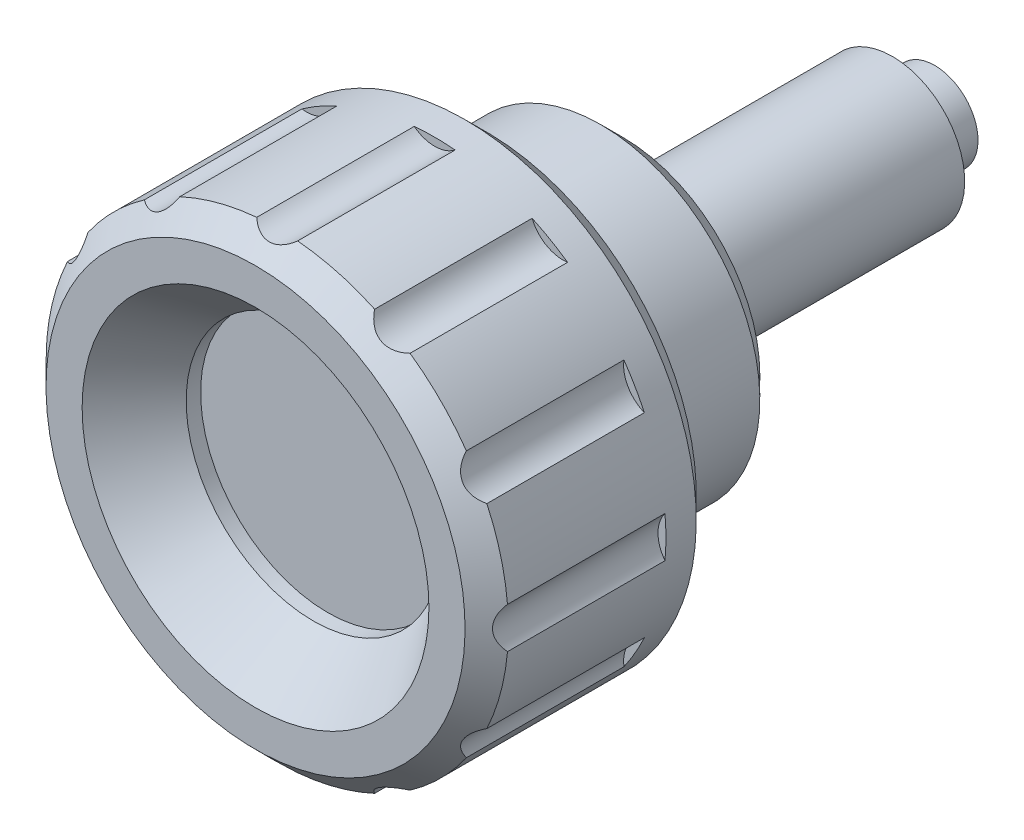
ISO-10303-21;
HEADER;
FILE_DESCRIPTION(('STEP AP214'),'2;1');
FILE_NAME('part.step','',(''),(''),'','','');
FILE_SCHEMA(('AUTOMOTIVE_DESIGN { 1 0 10303 214 1 1 1 1 }'));
ENDSEC;
DATA;
#1=APPLICATION_CONTEXT('core data for automotive mechanical design processes');
#2=APPLICATION_PROTOCOL_DEFINITION('international standard','automotive_design',2000,#1);
#3=PRODUCT_CONTEXT('',#1,'mechanical');
#4=PRODUCT('Part','Part','',(#3));
#5=PRODUCT_RELATED_PRODUCT_CATEGORY('part','',(#4));
#6=PRODUCT_DEFINITION_FORMATION('','',#4);
#7=PRODUCT_DEFINITION_CONTEXT('part definition',#1,'design');
#8=PRODUCT_DEFINITION('design','',#6,#7);
#9=PRODUCT_DEFINITION_SHAPE('','',#8);
#10=(LENGTH_UNIT() NAMED_UNIT(*) SI_UNIT(.MILLI.,.METRE.));
#11=(NAMED_UNIT(*) PLANE_ANGLE_UNIT() SI_UNIT($,.RADIAN.));
#12=(NAMED_UNIT(*) SI_UNIT($,.STERADIAN.) SOLID_ANGLE_UNIT());
#13=UNCERTAINTY_MEASURE_WITH_UNIT(LENGTH_MEASURE(1.E-05),#10,'distance_accuracy_value','');
#14=(GEOMETRIC_REPRESENTATION_CONTEXT(3) GLOBAL_UNCERTAINTY_ASSIGNED_CONTEXT((#13)) GLOBAL_UNIT_ASSIGNED_CONTEXT((#10,
#11,#12)) REPRESENTATION_CONTEXT('',''));
#15=CARTESIAN_POINT('',(0.,0.,0.));
#16=DIRECTION('',(0.,0.,1.));
#17=DIRECTION('',(1.,0.,0.));
#18=AXIS2_PLACEMENT_3D('',#15,#16,#17);
#19=CARTESIAN_POINT('',(0.,0.,6.5));
#20=DIRECTION('',(0.,0.,-1.));
#21=DIRECTION('',(0.996338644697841,0.0854944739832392,0.));
#22=AXIS2_PLACEMENT_3D('',#19,#20,#21);
#23=CYLINDRICAL_SURFACE('',#22,2.5);
#24=CARTESIAN_POINT('',(0.,0.,0.45));
#25=DIRECTION('',(0.,0.,-1.));
#26=DIRECTION('',(-1.,0.,0.));
#27=AXIS2_PLACEMENT_3D('',#24,#25,#26);
#28=CIRCLE('',#27,2.5);
#29=CARTESIAN_POINT('',(-2.5,0.,0.45));
#30=VERTEX_POINT('',#29);
#31=EDGE_CURVE('E9',#30,#30,#28,.F.);
#32=ORIENTED_EDGE('',*,*,#31,.F.);
#33=EDGE_LOOP('',(#32));
#34=FACE_BOUND('',#33,.T.);
#35=CARTESIAN_POINT('',(0.,0.,-9.0381197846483));
#36=DIRECTION('',(0.,0.,-1.));
#37=DIRECTION('',(0.996338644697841,0.0854944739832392,0.));
#38=AXIS2_PLACEMENT_3D('',#35,#36,#37);
#39=CIRCLE('',#38,2.5);
#40=CARTESIAN_POINT('',(2.4908466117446,0.213736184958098,-9.0381197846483));
#41=VERTEX_POINT('',#40);
#42=EDGE_CURVE('E23',#41,#41,#39,.F.);
#43=ORIENTED_EDGE('',*,*,#42,.T.);
#44=EDGE_LOOP('',(#43));
#45=FACE_BOUND('',#44,.T.);
#46=ADVANCED_FACE('F14',(#34,#45),#23,.T.);
#47=CARTESIAN_POINT('',(0.128241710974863,-1.49450796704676,-9.5));
#48=DIRECTION('',(0.,0.,-1.));
#49=DIRECTION('',(0.996338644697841,0.0854944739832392,0.));
#50=AXIS2_PLACEMENT_3D('',#47,#48,#49);
#51=PLANE('',#50);
#52=CARTESIAN_POINT('',(0.,0.,-9.5));
#53=DIRECTION('',(0.,0.,-1.));
#54=DIRECTION('',(0.996338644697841,0.0854944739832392,0.));
#55=AXIS2_PLACEMENT_3D('',#52,#53,#54);
#56=CIRCLE('',#55,1.7);
#57=CARTESIAN_POINT('',(1.69377569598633,0.145340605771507,-9.5));
#58=VERTEX_POINT('',#57);
#59=EDGE_CURVE('E456',#58,#58,#56,.T.);
#60=ORIENTED_EDGE('',*,*,#59,.T.);
#61=EDGE_LOOP('',(#60));
#62=FACE_BOUND('',#61,.T.);
#63=CARTESIAN_POINT('',(0.,0.,-9.5));
#64=DIRECTION('',(0.,0.,-1.));
#65=DIRECTION('',(0.996338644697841,0.0854944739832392,0.));
#66=AXIS2_PLACEMENT_3D('',#63,#64,#65);
#67=CIRCLE('',#66,1.5);
#68=CARTESIAN_POINT('',(1.49450796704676,0.128241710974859,-9.5));
#69=VERTEX_POINT('',#68);
#70=EDGE_CURVE('E451',#69,#69,#67,.T.);
#71=ORIENTED_EDGE('',*,*,#70,.F.);
#72=EDGE_LOOP('',(#71));
#73=FACE_BOUND('',#72,.T.);
#74=ADVANCED_FACE('F471',(#62,#73),#51,.T.);
#75=CARTESIAN_POINT('',(0.,0.,6.5));
#76=DIRECTION('',(0.,0.,-1.));
#77=DIRECTION('',(0.996338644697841,0.0854944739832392,0.));
#78=AXIS2_PLACEMENT_3D('',#75,#76,#77);
#79=CYLINDRICAL_SURFACE('',#78,1.5);
#80=ORIENTED_EDGE('',*,*,#70,.T.);
#81=EDGE_LOOP('',(#80));
#82=FACE_BOUND('',#81,.T.);
#83=CARTESIAN_POINT('',(0.,0.,-10.5));
#84=DIRECTION('',(0.,0.,-1.));
#85=DIRECTION('',(0.996338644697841,0.0854944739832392,0.));
#86=AXIS2_PLACEMENT_3D('',#83,#84,#85);
#87=CIRCLE('',#86,1.5);
#88=CARTESIAN_POINT('',(1.49450796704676,0.128241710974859,-10.5));
#89=VERTEX_POINT('',#88);
#90=EDGE_CURVE('E448',#89,#89,#87,.T.);
#91=ORIENTED_EDGE('',*,*,#90,.F.);
#92=EDGE_LOOP('',(#91));
#93=FACE_BOUND('',#92,.T.);
#94=ADVANCED_FACE('F474',(#82,#93),#79,.T.);
#95=CARTESIAN_POINT('',(0.,0.,-10.5));
#96=DIRECTION('',(0.,0.,-1.));
#97=DIRECTION('',(0.996338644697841,0.0854944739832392,0.));
#98=AXIS2_PLACEMENT_3D('',#95,#96,#97);
#99=PLANE('',#98);
#100=ORIENTED_EDGE('',*,*,#90,.T.);
#101=EDGE_LOOP('',(#100));
#102=FACE_BOUND('',#101,.T.);
#103=ADVANCED_FACE('F467',(#102),#99,.T.);
#104=CARTESIAN_POINT('',(0.,0.,-9.5));
#105=DIRECTION('',(0.,0.,1.));
#106=DIRECTION('',(-0.996338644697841,-0.0854944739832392,0.));
#107=AXIS2_PLACEMENT_3D('',#104,#105,#106);
#108=CONICAL_SURFACE('',#107,1.7,1.0471975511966);
#109=ORIENTED_EDGE('',*,*,#42,.F.);
#110=EDGE_LOOP('',(#109));
#111=FACE_BOUND('',#110,.T.);
#112=ORIENTED_EDGE('',*,*,#59,.F.);
#113=EDGE_LOOP('',(#112));
#114=FACE_BOUND('',#113,.T.);
#115=ADVANCED_FACE('F426',(#111,#114),#108,.T.);
#116=CARTESIAN_POINT('',(4.4,0.,10.5));
#117=DIRECTION('',(0.,0.,1.));
#118=DIRECTION('',(0.,-1.,0.));
#119=AXIS2_PLACEMENT_3D('',#116,#117,#118);
#120=PLANE('',#119);
#121=CARTESIAN_POINT('',(0.,0.,10.5));
#122=DIRECTION('',(0.,0.,-1.));
#123=DIRECTION('',(0.,1.,0.));
#124=AXIS2_PLACEMENT_3D('',#121,#122,#123);
#125=CIRCLE('',#124,4.4);
#126=CARTESIAN_POINT('',(0.,4.4,10.5));
#127=VERTEX_POINT('',#126);
#128=EDGE_CURVE('E289',#127,#127,#125,.T.);
#129=ORIENTED_EDGE('',*,*,#128,.F.);
#130=EDGE_LOOP('',(#129));
#131=FACE_BOUND('',#130,.T.);
#132=ADVANCED_FACE('F395',(#131),#120,.T.);
#133=CARTESIAN_POINT('',(0.,0.,0.));
#134=DIRECTION('',(0.,0.,-1.));
#135=DIRECTION('',(0.,1.,0.));
#136=AXIS2_PLACEMENT_3D('',#133,#134,#135);
#137=CYLINDRICAL_SURFACE('',#136,4.4);
#138=ORIENTED_EDGE('',*,*,#128,.T.);
#139=EDGE_LOOP('',(#138));
#140=FACE_BOUND('',#139,.T.);
#141=CARTESIAN_POINT('',(0.,0.,11.));
#142=DIRECTION('',(0.,0.,-1.));
#143=DIRECTION('',(0.,1.,0.));
#144=AXIS2_PLACEMENT_3D('',#141,#142,#143);
#145=CIRCLE('',#144,4.4);
#146=CARTESIAN_POINT('',(0.,4.4,11.));
#147=VERTEX_POINT('',#146);
#148=EDGE_CURVE('E333',#147,#147,#145,.T.);
#149=ORIENTED_EDGE('',*,*,#148,.F.);
#150=EDGE_LOOP('',(#149));
#151=FACE_BOUND('',#150,.T.);
#152=ADVANCED_FACE('F391',(#140,#151),#137,.F.);
#153=CARTESIAN_POINT('',(0.,0.,13.));
#154=DIRECTION('',(0.,0.,1.));
#155=DIRECTION('',(0.,-1.,0.));
#156=AXIS2_PLACEMENT_3D('',#153,#154,#155);
#157=CONICAL_SURFACE('',#156,6.,0.67474094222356);
#158=ORIENTED_EDGE('',*,*,#148,.T.);
#159=EDGE_LOOP('',(#158));
#160=FACE_BOUND('',#159,.T.);
#161=CARTESIAN_POINT('',(0.,0.,13.));
#162=DIRECTION('',(0.,0.,-1.));
#163=DIRECTION('',(0.,1.,0.));
#164=AXIS2_PLACEMENT_3D('',#161,#162,#163);
#165=CIRCLE('',#164,6.);
#166=CARTESIAN_POINT('',(0.,6.,13.));
#167=VERTEX_POINT('',#166);
#168=EDGE_CURVE('E336',#167,#167,#165,.T.);
#169=ORIENTED_EDGE('',*,*,#168,.F.);
#170=EDGE_LOOP('',(#169));
#171=FACE_BOUND('',#170,.T.);
#172=ADVANCED_FACE('F394',(#160,#171),#157,.F.);
#173=CARTESIAN_POINT('',(6.,0.,13.));
#174=DIRECTION('',(0.,0.,1.));
#175=DIRECTION('',(0.,-1.,0.));
#176=AXIS2_PLACEMENT_3D('',#173,#174,#175);
#177=PLANE('',#176);
#178=ORIENTED_EDGE('',*,*,#168,.T.);
#179=EDGE_LOOP('',(#178));
#180=FACE_BOUND('',#179,.T.);
#181=CARTESIAN_POINT('',(0.,0.,13.));
#182=DIRECTION('',(0.,0.,-1.));
#183=DIRECTION('',(0.,1.,0.));
#184=AXIS2_PLACEMENT_3D('',#181,#182,#183);
#185=CIRCLE('',#184,7.25);
#186=CARTESIAN_POINT('',(0.,7.25,13.));
#187=VERTEX_POINT('',#186);
#188=EDGE_CURVE('E339',#187,#187,#185,.T.);
#189=ORIENTED_EDGE('',*,*,#188,.F.);
#190=EDGE_LOOP('',(#189));
#191=FACE_BOUND('',#190,.T.);
#192=ADVANCED_FACE('F387',(#180,#191),#177,.T.);
#193=CARTESIAN_POINT('',(0.,0.,6.8));
#194=DIRECTION('',(0.,0.,1.));
#195=DIRECTION('',(0.,-1.,0.));
#196=AXIS2_PLACEMENT_3D('',#193,#194,#195);
#197=PLANE('',#196);
#198=CARTESIAN_POINT('',(-1.2490009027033E-13,-8.87500000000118,6.8));
#199=DIRECTION('',(0.,0.,-1.));
#200=DIRECTION('',(0.,-1.,0.));
#201=AXIS2_PLACEMENT_3D('',#198,#199,#200);
#202=CIRCLE('',#201,1.15);
#203=CARTESIAN_POINT('',(-0.707804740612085,-7.96862676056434,6.8));
#204=VERTEX_POINT('',#203);
#205=CARTESIAN_POINT('',(0.707804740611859,-7.96862676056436,6.8));
#206=VERTEX_POINT('',#205);
#207=EDGE_CURVE('E276',#204,#206,#202,.T.);
#208=ORIENTED_EDGE('',*,*,#207,.F.);
#209=CARTESIAN_POINT('',(0.,0.,6.8));
#210=DIRECTION('',(0.,0.,1.));
#211=DIRECTION('',(0.,-1.,0.));
#212=AXIS2_PLACEMENT_3D('',#209,#210,#211);
#213=CIRCLE('',#212,8.);
#214=EDGE_CURVE('E223',#206,#204,#213,.F.);
#215=ORIENTED_EDGE('',*,*,#214,.F.);
#216=EDGE_LOOP('',(#208,#215));
#217=FACE_BOUND('',#216,.T.);
#218=ADVANCED_FACE('F383',(#217),#197,.T.);
#219=CARTESIAN_POINT('',(-1.2490009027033E-13,-8.87500000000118,6.8));
#220=DIRECTION('',(0.,0.,1.));
#221=DIRECTION('',(0.,-1.,0.));
#222=AXIS2_PLACEMENT_3D('',#219,#220,#221);
#223=CYLINDRICAL_SURFACE('',#222,1.15);
#224=DIRECTION('',(0.,0.,1.));
#225=VECTOR('',#224,1.);
#226=CARTESIAN_POINT('',(-0.707804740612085,-7.96862676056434,6.8));
#227=LINE('',#226,#225);
#228=CARTESIAN_POINT('',(-0.707804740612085,-7.96862676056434,12.2499999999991));
#229=VERTEX_POINT('',#228);
#230=EDGE_CURVE('E302',#204,#229,#227,.T.);
#231=ORIENTED_EDGE('',*,*,#230,.F.);
#232=ORIENTED_EDGE('',*,*,#207,.T.);
#233=DIRECTION('',(0.,0.,1.));
#234=VECTOR('',#233,1.);
#235=CARTESIAN_POINT('',(0.707804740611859,-7.96862676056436,6.8));
#236=LINE('',#235,#234);
#237=CARTESIAN_POINT('',(0.707804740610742,-7.96862676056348,12.25));
#238=VERTEX_POINT('',#237);
#239=EDGE_CURVE('E300',#206,#238,#236,.T.);
#240=ORIENTED_EDGE('',*,*,#239,.T.);
#241=CARTESIAN_POINT('',(-0.708004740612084,-7.96878298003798,12.2498266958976));
#242=CARTESIAN_POINT('',(-0.670016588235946,-7.93910304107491,12.2827435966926));
#243=CARTESIAN_POINT('',(-0.629096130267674,-7.91098728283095,12.3141461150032));
#244=CARTESIAN_POINT('',(-0.541113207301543,-7.85895957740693,12.372548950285));
#245=CARTESIAN_POINT('',(-0.49399360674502,-7.83509230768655,12.3995022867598));
#246=CARTESIAN_POINT('',(-0.403110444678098,-7.7970545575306,12.4426329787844));
#247=CARTESIAN_POINT('',(-0.360275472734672,-7.78191147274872,12.4598771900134));
#248=CARTESIAN_POINT('',(-0.271519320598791,-7.75656520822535,12.4888070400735));
#249=CARTESIAN_POINT('',(-0.225610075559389,-7.74634405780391,12.5005128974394));
#250=CARTESIAN_POINT('',(-0.13128174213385,-7.73151414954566,12.5175147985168));
#251=CARTESIAN_POINT('',(-0.0828445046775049,-7.72695427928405,12.522755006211));
#252=CARTESIAN_POINT('',(0.0144870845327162,-7.72406175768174,12.5260777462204));
#253=CARTESIAN_POINT('',(0.0633815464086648,-7.72573064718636,12.5241585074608));
#254=CARTESIAN_POINT('',(0.154026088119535,-7.73456075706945,12.5140225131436));
#255=CARTESIAN_POINT('',(0.195934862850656,-7.74104594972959,12.5065809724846));
#256=CARTESIAN_POINT('',(0.277692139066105,-7.75824805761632,12.4868901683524));
#257=CARTESIAN_POINT('',(0.317539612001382,-7.76896706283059,12.4746385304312));
#258=CARTESIAN_POINT('',(0.408286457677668,-7.79851491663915,12.440973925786));
#259=CARTESIAN_POINT('',(0.458050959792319,-7.81887290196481,12.4178517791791));
#260=CARTESIAN_POINT('',(0.551931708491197,-7.86474498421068,12.3660439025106));
#261=CARTESIAN_POINT('',(0.596041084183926,-7.89026525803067,12.3373515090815));
#262=CARTESIAN_POINT('',(0.66188083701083,-7.9341069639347,12.2883657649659));
#263=CARTESIAN_POINT('',(0.685443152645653,-7.95116148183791,12.2693731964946));
#264=CARTESIAN_POINT('',(0.708004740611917,-7.96878298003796,12.2498266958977));
#265=B_SPLINE_CURVE_WITH_KNOTS('',3,(#241,#242,#243,#244,#245,#246,#247,#248,#249,#250,#251,
#252,#253,#254,#255,#256,#257,#258,#259,#260,#261,#262,#263,#264),.UNSPECIFIED.,.F.,.F.,(4,2,2,
2,2,2,2,2,2,2,2,4),(0.,0.175420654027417,0.352589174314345,0.497789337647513,0.642455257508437,
0.788361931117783,0.934304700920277,1.06290984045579,1.19157854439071,1.36619586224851,
1.54102336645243,1.64509140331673),.UNSPECIFIED.);
#266=EDGE_CURVE('E517',#229,#238,#265,.T.);
#267=ORIENTED_EDGE('',*,*,#266,.F.);
#268=EDGE_LOOP('',(#231,#232,#240,#267));
#269=FACE_BOUND('',#268,.T.);
#270=ADVANCED_FACE('F386',(#269),#223,.F.);
#271=CARTESIAN_POINT('',(4.43750000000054,-7.68597545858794,6.8));
#272=DIRECTION('',(0.,0.,-1.));
#273=DIRECTION('',(0.,-1.,0.));
#274=AXIS2_PLACEMENT_3D('',#271,#272,#273);
#275=CIRCLE('',#274,1.15);
#276=CARTESIAN_POINT('',(3.37133649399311,-7.25493557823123,6.8));
#277=VERTEX_POINT('',#276);
#278=CARTESIAN_POINT('',(4.59729026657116,-6.54713083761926,6.8));
#279=VERTEX_POINT('',#278);
#280=EDGE_CURVE('E279',#277,#279,#275,.T.);
#281=ORIENTED_EDGE('',*,*,#280,.F.);
#282=EDGE_CURVE('E219',#279,#277,#213,.F.);
#283=ORIENTED_EDGE('',*,*,#282,.F.);
#284=EDGE_LOOP('',(#281,#283));
#285=FACE_BOUND('',#284,.T.);
#286=ADVANCED_FACE('F390',(#285),#197,.T.);
#287=CARTESIAN_POINT('',(4.43750000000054,-7.68597545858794,6.8));
#288=DIRECTION('',(0.,0.,1.));
#289=DIRECTION('',(0.,-1.,0.));
#290=AXIS2_PLACEMENT_3D('',#287,#288,#289);
#291=CYLINDRICAL_SURFACE('',#290,1.15);
#292=DIRECTION('',(0.,0.,1.));
#293=VECTOR('',#292,1.);
#294=CARTESIAN_POINT('',(3.37133649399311,-7.25493557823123,6.8));
#295=LINE('',#294,#293);
#296=CARTESIAN_POINT('',(3.37133649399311,-7.25493557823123,12.2499999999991));
#297=VERTEX_POINT('',#296);
#298=EDGE_CURVE('E298',#277,#297,#295,.T.);
#299=ORIENTED_EDGE('',*,*,#298,.F.);
#300=ORIENTED_EDGE('',*,*,#280,.T.);
#301=DIRECTION('',(0.,0.,1.));
#302=VECTOR('',#301,1.);
#303=CARTESIAN_POINT('',(4.59729026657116,-6.54713083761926,6.8));
#304=LINE('',#303,#302);
#305=CARTESIAN_POINT('',(4.59729026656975,-6.54713083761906,12.25));
#306=VERTEX_POINT('',#305);
#307=EDGE_CURVE('E296',#279,#306,#304,.T.);
#308=ORIENTED_EDGE('',*,*,#307,.T.);
#309=CARTESIAN_POINT('',(3.37125565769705,-7.25513557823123,12.2498526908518));
#310=CARTESIAN_POINT('',(3.38931533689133,-7.21043982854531,12.2827673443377));
#311=CARTESIAN_POINT('',(3.41069638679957,-7.16563264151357,12.3141675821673));
#312=CARTESIAN_POINT('',(3.46087905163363,-7.07658806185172,12.3725658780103));
#313=CARTESIAN_POINT('',(3.48975247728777,-7.03236079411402,12.399516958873));
#314=CARTESIAN_POINT('',(3.54944136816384,-6.95398075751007,12.4426442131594));
#315=CARTESIAN_POINT('',(3.57896658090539,-6.91945000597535,12.459887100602));
#316=CARTESIAN_POINT('',(3.64315945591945,-6.85312362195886,12.4888142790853));
#317=CARTESIAN_POINT('',(3.67780779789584,-6.82131839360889,12.5005187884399));
#318=CARTESIAN_POINT('',(3.75208390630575,-6.76131362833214,12.5175180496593));
#319=CARTESIAN_POINT('',(3.79175182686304,-6.73314735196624,12.5227569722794));
#320=CARTESIAN_POINT('',(3.87459677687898,-6.68197914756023,12.5260773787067));
#321=CARTESIAN_POINT('',(3.91777467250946,-6.65897849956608,12.5241570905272));
#322=CARTESIAN_POINT('',(4.00068974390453,-6.62130533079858,12.5140193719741));
#323=CARTESIAN_POINT('',(4.04022639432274,-6.60596809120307,12.5065770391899));
#324=CARTESIAN_POINT('',(4.1196311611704,-6.57998847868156,12.4868847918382));
#325=CARTESIAN_POINT('',(4.15949943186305,-6.56934843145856,12.4746325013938));
#326=CARTESIAN_POINT('',(4.25286326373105,-6.54956561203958,12.4409660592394));
#327=CARTESIAN_POINT('',(4.30614049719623,-6.54231471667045,12.4178426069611));
#328=CARTESIAN_POINT('',(4.41038121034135,-6.53510255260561,12.366032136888));
#329=CARTESIAN_POINT('',(4.46134183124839,-6.53515005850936,12.3373384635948));
#330=CARTESIAN_POINT('',(4.54025639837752,-6.54019818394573,12.2883669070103));
#331=CARTESIAN_POINT('',(4.5691644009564,-6.54318368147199,12.269391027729));
#332=CARTESIAN_POINT('',(4.59749026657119,-6.54715891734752,12.249862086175));
#333=B_SPLINE_CURVE_WITH_KNOTS('',3,(#309,#310,#311,#312,#313,#314,#315,#316,#317,#318,#319,
#320,#321,#322,#323,#324,#325,#326,#327,#328,#329,#330,#331,#332),.UNSPECIFIED.,.F.,.F.,(4,2,2,
2,2,2,2,2,2,2,2,4),(0.,0.175413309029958,0.352574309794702,0.497771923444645,0.642435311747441,
0.788339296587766,0.934279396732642,1.06288407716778,1.19155236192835,1.3661734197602,
1.54100441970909,1.64498267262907),.UNSPECIFIED.);
#334=EDGE_CURVE('E510',#297,#306,#333,.T.);
#335=ORIENTED_EDGE('',*,*,#334,.F.);
#336=EDGE_LOOP('',(#299,#300,#308,#335));
#337=FACE_BOUND('',#336,.T.);
#338=ADVANCED_FACE('F524',(#337),#291,.F.);
#339=CARTESIAN_POINT('',(7.68597545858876,-4.43749999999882,6.8));
#340=DIRECTION('',(0.,0.,-1.));
#341=DIRECTION('',(0.,-1.,0.));
#342=AXIS2_PLACEMENT_3D('',#339,#340,#341);
#343=CIRCLE('',#342,1.15000000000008);
#344=CARTESIAN_POINT('',(6.54713083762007,-4.59729026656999,6.8));
#345=VERTEX_POINT('',#344);
#346=CARTESIAN_POINT('',(7.25493557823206,-3.37133649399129,6.8));
#347=VERTEX_POINT('',#346);
#348=EDGE_CURVE('E282',#345,#347,#343,.T.);
#349=ORIENTED_EDGE('',*,*,#348,.F.);
#350=EDGE_CURVE('E213',#347,#345,#213,.F.);
#351=ORIENTED_EDGE('',*,*,#350,.F.);
#352=EDGE_LOOP('',(#349,#351));
#353=FACE_BOUND('',#352,.T.);
#354=ADVANCED_FACE('F527',(#353),#197,.T.);
#355=CARTESIAN_POINT('',(7.68597545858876,-4.43749999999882,6.8));
#356=DIRECTION('',(0.,0.,1.));
#357=DIRECTION('',(0.,-1.,0.));
#358=AXIS2_PLACEMENT_3D('',#355,#356,#357);
#359=CYLINDRICAL_SURFACE('',#358,1.15000000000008);
#360=DIRECTION('',(0.,0.,1.));
#361=VECTOR('',#360,1.);
#362=CARTESIAN_POINT('',(6.54713083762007,-4.59729026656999,6.8));
#363=LINE('',#362,#361);
#364=CARTESIAN_POINT('',(6.54713083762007,-4.59729026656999,12.2499999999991));
#365=VERTEX_POINT('',#364);
#366=EDGE_CURVE('E294',#345,#365,#363,.T.);
#367=ORIENTED_EDGE('',*,*,#366,.F.);
#368=ORIENTED_EDGE('',*,*,#348,.T.);
#369=DIRECTION('',(0.,0.,1.));
#370=VECTOR('',#369,1.);
#371=CARTESIAN_POINT('',(7.25493557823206,-3.37133649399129,6.8));
#372=LINE('',#371,#370);
#373=CARTESIAN_POINT('',(7.25493557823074,-3.37133649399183,12.25));
#374=VERTEX_POINT('',#373);
#375=EDGE_CURVE('E292',#347,#374,#372,.T.);
#376=ORIENTED_EDGE('',*,*,#375,.T.);
#377=CARTESIAN_POINT('',(6.54715891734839,-4.59749026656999,12.249862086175));
#378=CARTESIAN_POINT('',(6.54045182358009,-4.54975319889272,12.2827759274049));
#379=CARTESIAN_POINT('',(6.5365653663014,-4.50025899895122,12.3141753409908));
#380=CARTESIAN_POINT('',(6.53550363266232,-4.39805391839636,12.3725719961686));
#381=CARTESIAN_POINT('',(6.53839560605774,-4.34531590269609,12.3995222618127));
#382=CARTESIAN_POINT('',(6.55089846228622,-4.24759324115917,12.4426482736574));
#383=CARTESIAN_POINT('',(6.55920303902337,-4.20292634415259,12.4598906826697));
#384=CARTESIAN_POINT('',(6.58163319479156,-4.11339009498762,12.4888168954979));
#385=CARTESIAN_POINT('',(6.59573724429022,-4.0685220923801,12.5005209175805));
#386=CARTESIAN_POINT('',(6.63006040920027,-3.97941910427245,12.5175192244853));
#387=CARTESIAN_POINT('',(6.65033092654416,-3.93519284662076,12.5227576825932));
#388=CARTESIAN_POINT('',(6.69649299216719,-3.84945829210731,12.5260772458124));
#389=CARTESIAN_POINT('',(6.72238593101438,-3.80795067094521,12.5241565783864));
#390=CARTESIAN_POINT('',(6.77535612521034,-3.73386792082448,12.5140182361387));
#391=CARTESIAN_POINT('',(6.80192739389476,-3.70081740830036,12.5065756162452));
#392=CARTESIAN_POINT('',(6.85770436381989,-3.63861654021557,12.486882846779));
#393=CARTESIAN_POINT('',(6.88691136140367,-3.60946812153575,12.4746303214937));
#394=CARTESIAN_POINT('',(6.95787590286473,-3.54565408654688,12.4409632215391));
#395=CARTESIAN_POINT('',(7.00039031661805,-3.51273611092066,12.4178393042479));
#396=CARTESIAN_POINT('',(7.08706015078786,-3.45437012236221,12.3660279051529));
#397=CARTESIAN_POINT('',(7.13121748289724,-3.42893113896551,12.3373337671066));
#398=CARTESIAN_POINT('',(7.20208570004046,-3.39384524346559,12.2883604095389));
#399=CARTESIAN_POINT('',(7.22861528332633,-3.38197627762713,12.2693831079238));
#400=CARTESIAN_POINT('',(7.25513557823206,-3.37125565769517,12.2498526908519));
#401=B_SPLINE_CURVE_WITH_KNOTS('',3,(#377,#378,#379,#380,#381,#382,#383,#384,#385,#386,#387,
#388,#389,#390,#391,#392,#393,#394,#395,#396,#397,#398,#399,#400),.UNSPECIFIED.,.F.,.F.,(4,2,2,
2,2,2,2,2,2,2,2,4),(0.,0.175410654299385,0.352568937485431,0.497765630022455,0.642428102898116,
0.788331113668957,0.934270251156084,1.0628747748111,1.19154289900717,1.36616525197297,
1.54099757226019,1.64498268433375),.UNSPECIFIED.);
#402=EDGE_CURVE('E208',#365,#374,#401,.T.);
#403=ORIENTED_EDGE('',*,*,#402,.F.);
#404=EDGE_LOOP('',(#367,#368,#376,#403));
#405=FACE_BOUND('',#404,.T.);
#406=ADVANCED_FACE('F496',(#405),#359,.F.);
#407=CARTESIAN_POINT('',(8.87500000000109,1.83967424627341E-12,6.8));
#408=DIRECTION('',(0.,0.,-1.));
#409=DIRECTION('',(0.,-1.,0.));
#410=AXIS2_PLACEMENT_3D('',#407,#408,#409);
#411=CIRCLE('',#410,1.15);
#412=CARTESIAN_POINT('',(7.96862676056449,-0.70780474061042,6.8));
#413=VERTEX_POINT('',#412);
#414=CARTESIAN_POINT('',(7.96862676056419,0.70780474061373,6.8));
#415=VERTEX_POINT('',#414);
#416=EDGE_CURVE('E191',#413,#415,#411,.T.);
#417=ORIENTED_EDGE('',*,*,#416,.F.);
#418=EDGE_CURVE('E204',#415,#413,#213,.F.);
#419=ORIENTED_EDGE('',*,*,#418,.F.);
#420=EDGE_LOOP('',(#417,#419));
#421=FACE_BOUND('',#420,.T.);
#422=ADVANCED_FACE('F494',(#421),#197,.T.);
#423=CARTESIAN_POINT('',(8.87500000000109,1.83967424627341E-12,6.8));
#424=DIRECTION('',(0.,0.,1.));
#425=DIRECTION('',(0.,-1.,0.));
#426=AXIS2_PLACEMENT_3D('',#423,#424,#425);
#427=CYLINDRICAL_SURFACE('',#426,1.15);
#428=DIRECTION('',(0.,0.,1.));
#429=VECTOR('',#428,1.);
#430=CARTESIAN_POINT('',(7.96862676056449,-0.70780474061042,6.8));
#431=LINE('',#430,#429);
#432=CARTESIAN_POINT('',(7.96862676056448,-0.70780474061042,12.2499999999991));
#433=VERTEX_POINT('',#432);
#434=EDGE_CURVE('E290',#413,#433,#431,.T.);
#435=ORIENTED_EDGE('',*,*,#434,.F.);
#436=ORIENTED_EDGE('',*,*,#416,.T.);
#437=DIRECTION('',(0.,0.,1.));
#438=VECTOR('',#437,1.);
#439=CARTESIAN_POINT('',(7.96862676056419,0.70780474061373,6.8));
#440=LINE('',#439,#438);
#441=CARTESIAN_POINT('',(7.96862676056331,0.70780474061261,12.25));
#442=VERTEX_POINT('',#441);
#443=EDGE_CURVE('E287',#415,#442,#440,.T.);
#444=ORIENTED_EDGE('',*,*,#443,.T.);
#445=CARTESIAN_POINT('',(7.96878298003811,-0.70800474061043,12.2498266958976));
#446=CARTESIAN_POINT('',(7.93910304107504,-0.670016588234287,12.2827435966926));
#447=CARTESIAN_POINT('',(7.91098728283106,-0.629096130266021,12.3141461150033));
#448=CARTESIAN_POINT('',(7.85895957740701,-0.541113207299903,12.3725489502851));
#449=CARTESIAN_POINT('',(7.8350923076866,-0.493993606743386,12.3995022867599));
#450=CARTESIAN_POINT('',(7.79705455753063,-0.403110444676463,12.4426329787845));
#451=CARTESIAN_POINT('',(7.78191147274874,-0.360275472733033,12.4598771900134));
#452=CARTESIAN_POINT('',(7.75656520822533,-0.271519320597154,12.4888070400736));
#453=CARTESIAN_POINT('',(7.74634405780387,-0.225610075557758,12.5005128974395));
#454=CARTESIAN_POINT('',(7.73151414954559,-0.131281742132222,12.5175147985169));
#455=CARTESIAN_POINT('',(7.72695427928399,-0.0828445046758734,12.5227550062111));
#456=CARTESIAN_POINT('',(7.72406175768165,0.0144870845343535,12.5260777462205));
#457=CARTESIAN_POINT('',(7.72573064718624,0.0633815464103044,12.5241585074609));
#458=CARTESIAN_POINT('',(7.73456075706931,0.15402608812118,12.5140225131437));
#459=CARTESIAN_POINT('',(7.74104594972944,0.195934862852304,12.5065809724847));
#460=CARTESIAN_POINT('',(7.75824805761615,0.277692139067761,12.4868901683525));
#461=CARTESIAN_POINT('',(7.7689670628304,0.317539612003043,12.4746385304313));
#462=CARTESIAN_POINT('',(7.79851491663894,0.408286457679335,12.4409739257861));
#463=CARTESIAN_POINT('',(7.81887290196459,0.458050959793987,12.4178517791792));
#464=CARTESIAN_POINT('',(7.86474498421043,0.551931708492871,12.3660439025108));
#465=CARTESIAN_POINT('',(7.8902652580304,0.596041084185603,12.3373515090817));
#466=CARTESIAN_POINT('',(7.93410696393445,0.661880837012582,12.288365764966));
#467=CARTESIAN_POINT('',(7.9511614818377,0.685443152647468,12.2693731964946));
#468=CARTESIAN_POINT('',(7.96878298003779,0.708004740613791,12.2498266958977));
#469=B_SPLINE_CURVE_WITH_KNOTS('',3,(#445,#446,#447,#448,#449,#450,#451,#452,#453,#454,#455,
#456,#457,#458,#459,#460,#461,#462,#463,#464,#465,#466,#467,#468),.UNSPECIFIED.,.F.,.F.,(4,2,2,
2,2,2,2,2,2,2,2,4),(0.,0.17542065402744,0.352589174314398,0.497789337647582,0.642455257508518,
0.788361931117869,0.934304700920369,1.06290984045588,1.19157854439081,1.36619586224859,
1.54102336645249,1.64509140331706),.UNSPECIFIED.);
#470=EDGE_CURVE('E202',#433,#442,#469,.T.);
#471=ORIENTED_EDGE('',*,*,#470,.F.);
#472=EDGE_LOOP('',(#435,#436,#444,#471));
#473=FACE_BOUND('',#472,.T.);
#474=ADVANCED_FACE('F490',(#473),#427,.F.);
#475=CARTESIAN_POINT('',(7.68597545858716,4.43750000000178,6.8));
#476=DIRECTION('',(0.,0.,-1.));
#477=DIRECTION('',(0.,-1.,0.));
#478=AXIS2_PLACEMENT_3D('',#475,#476,#477);
#479=CIRCLE('',#478,1.15);
#480=CARTESIAN_POINT('',(7.25493557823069,3.37133649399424,6.8));
#481=VERTEX_POINT('',#480);
#482=CARTESIAN_POINT('',(6.54713083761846,4.5972902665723,6.8));
#483=VERTEX_POINT('',#482);
#484=EDGE_CURVE('E182',#481,#483,#479,.T.);
#485=ORIENTED_EDGE('',*,*,#484,.F.);
#486=EDGE_CURVE('E195',#483,#481,#213,.F.);
#487=ORIENTED_EDGE('',*,*,#486,.F.);
#488=EDGE_LOOP('',(#485,#487));
#489=FACE_BOUND('',#488,.T.);
#490=ADVANCED_FACE('F194',(#489),#197,.T.);
#491=CARTESIAN_POINT('',(7.68597545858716,4.43750000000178,6.8));
#492=DIRECTION('',(0.,0.,1.));
#493=DIRECTION('',(0.,-1.,0.));
#494=AXIS2_PLACEMENT_3D('',#491,#492,#493);
#495=CYLINDRICAL_SURFACE('',#494,1.15);
#496=DIRECTION('',(0.,0.,1.));
#497=VECTOR('',#496,1.);
#498=CARTESIAN_POINT('',(7.25493557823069,3.37133649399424,6.8));
#499=LINE('',#498,#497);
#500=CARTESIAN_POINT('',(7.25493557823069,3.37133649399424,12.2499999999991));
#501=VERTEX_POINT('',#500);
#502=EDGE_CURVE('E179',#481,#501,#499,.T.);
#503=ORIENTED_EDGE('',*,*,#502,.F.);
#504=ORIENTED_EDGE('',*,*,#484,.T.);
#505=DIRECTION('',(0.,0.,1.));
#506=VECTOR('',#505,1.);
#507=CARTESIAN_POINT('',(6.54713083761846,4.5972902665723,6.8));
#508=LINE('',#507,#506);
#509=CARTESIAN_POINT('',(6.54713083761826,4.59729026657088,12.25));
#510=VERTEX_POINT('',#509);
#511=EDGE_CURVE('E190',#483,#510,#508,.T.);
#512=ORIENTED_EDGE('',*,*,#511,.T.);
#513=CARTESIAN_POINT('',(7.25513557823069,3.37125565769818,12.2498526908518));
#514=CARTESIAN_POINT('',(7.21043982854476,3.38931533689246,12.2827673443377));
#515=CARTESIAN_POINT('',(7.16563264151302,3.41069638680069,12.3141675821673));
#516=CARTESIAN_POINT('',(7.07658806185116,3.46087905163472,12.3725658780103));
#517=CARTESIAN_POINT('',(7.03236079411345,3.48975247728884,12.399516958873));
#518=CARTESIAN_POINT('',(6.95398075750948,3.54944136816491,12.4426442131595));
#519=CARTESIAN_POINT('',(6.91945000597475,3.57896658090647,12.459887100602));
#520=CARTESIAN_POINT('',(6.85312362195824,3.64315945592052,12.4888142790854));
#521=CARTESIAN_POINT('',(6.82131839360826,3.67780779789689,12.50051878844));
#522=CARTESIAN_POINT('',(6.7613136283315,3.75208390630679,12.5175180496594));
#523=CARTESIAN_POINT('',(6.73314735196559,3.79175182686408,12.5227569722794));
#524=CARTESIAN_POINT('',(6.68197914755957,3.87459677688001,12.5260773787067));
#525=CARTESIAN_POINT('',(6.65897849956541,3.9177746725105,12.5241570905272));
#526=CARTESIAN_POINT('',(6.62130533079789,4.00068974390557,12.5140193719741));
#527=CARTESIAN_POINT('',(6.60596809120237,4.04022639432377,12.50657703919));
#528=CARTESIAN_POINT('',(6.57998847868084,4.11963116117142,12.4868847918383));
#529=CARTESIAN_POINT('',(6.56934843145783,4.15949943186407,12.4746325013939));
#530=CARTESIAN_POINT('',(6.54956561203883,4.25286326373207,12.4409660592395));
#531=CARTESIAN_POINT('',(6.5423147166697,4.30614049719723,12.4178426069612));
#532=CARTESIAN_POINT('',(6.53510255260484,4.41038121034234,12.3660321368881));
#533=CARTESIAN_POINT('',(6.53515005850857,4.46134183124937,12.3373384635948));
#534=CARTESIAN_POINT('',(6.54019818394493,4.54025639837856,12.2883669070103));
#535=CARTESIAN_POINT('',(6.54318368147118,4.56916440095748,12.269391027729));
#536=CARTESIAN_POINT('',(6.54715891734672,4.59749026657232,12.249862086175));
#537=B_SPLINE_CURVE_WITH_KNOTS('',3,(#513,#514,#515,#516,#517,#518,#519,#520,#521,#522,#523,
#524,#525,#526,#527,#528,#529,#530,#531,#532,#533,#534,#535,#536),.UNSPECIFIED.,.F.,.F.,(4,2,2,
2,2,2,2,2,2,2,2,4),(0.,0.175413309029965,0.352574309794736,0.497771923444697,0.6424353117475,
0.788339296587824,0.934279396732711,1.06288407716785,1.1915523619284,1.36617341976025,
1.54100441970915,1.64498267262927),.UNSPECIFIED.);
#538=EDGE_CURVE('E185',#501,#510,#537,.T.);
#539=ORIENTED_EDGE('',*,*,#538,.F.);
#540=EDGE_LOOP('',(#503,#504,#512,#539));
#541=FACE_BOUND('',#540,.T.);
#542=ADVANCED_FACE('F181',(#541),#495,.F.);
#543=CARTESIAN_POINT('',(4.43750000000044,7.68597545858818,6.8));
#544=DIRECTION('',(0.,0.,-1.));
#545=DIRECTION('',(0.,-1.,0.));
#546=AXIS2_PLACEMENT_3D('',#543,#544,#545);
#547=CIRCLE('',#546,1.15);
#548=CARTESIAN_POINT('',(4.59729026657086,6.54713083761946,6.8));
#549=VERTEX_POINT('',#548);
#550=CARTESIAN_POINT('',(3.3713364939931,7.25493557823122,6.8));
#551=VERTEX_POINT('',#550);
#552=EDGE_CURVE('E196',#549,#551,#547,.T.);
#553=ORIENTED_EDGE('',*,*,#552,.F.);
#554=EDGE_CURVE('E201',#551,#549,#213,.F.);
#555=ORIENTED_EDGE('',*,*,#554,.F.);
#556=EDGE_LOOP('',(#553,#555));
#557=FACE_BOUND('',#556,.T.);
#558=ADVANCED_FACE('F379',(#557),#197,.T.);
#559=CARTESIAN_POINT('',(4.43750000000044,7.68597545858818,6.8));
#560=DIRECTION('',(0.,0.,1.));
#561=DIRECTION('',(0.,-1.,0.));
#562=AXIS2_PLACEMENT_3D('',#559,#560,#561);
#563=CYLINDRICAL_SURFACE('',#562,1.15);
#564=DIRECTION('',(0.,0.,1.));
#565=VECTOR('',#564,1.);
#566=CARTESIAN_POINT('',(4.59729026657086,6.54713083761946,6.8));
#567=LINE('',#566,#565);
#568=CARTESIAN_POINT('',(4.59729026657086,6.54713083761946,12.2499999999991));
#569=VERTEX_POINT('',#568);
#570=EDGE_CURVE('E327',#549,#569,#567,.T.);
#571=ORIENTED_EDGE('',*,*,#570,.F.);
#572=ORIENTED_EDGE('',*,*,#552,.T.);
#573=DIRECTION('',(0.,0.,1.));
#574=VECTOR('',#573,1.);
#575=CARTESIAN_POINT('',(3.3713364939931,7.25493557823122,6.8));
#576=LINE('',#575,#574);
#577=CARTESIAN_POINT('',(3.37133649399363,7.2549355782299,12.25));
#578=VERTEX_POINT('',#577);
#579=EDGE_CURVE('E325',#551,#578,#576,.T.);
#580=ORIENTED_EDGE('',*,*,#579,.T.);
#581=CARTESIAN_POINT('',(4.59749026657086,6.5471589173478,12.249862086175));
#582=CARTESIAN_POINT('',(4.5497531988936,6.54045182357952,12.2827759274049));
#583=CARTESIAN_POINT('',(4.50025899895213,6.53656536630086,12.3141753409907));
#584=CARTESIAN_POINT('',(4.39805391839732,6.53550363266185,12.3725719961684));
#585=CARTESIAN_POINT('',(4.34531590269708,6.53839560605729,12.3995222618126));
#586=CARTESIAN_POINT('',(4.2475932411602,6.55089846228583,12.4426482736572));
#587=CARTESIAN_POINT('',(4.20292634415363,6.55920303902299,12.4598906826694));
#588=CARTESIAN_POINT('',(4.11339009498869,6.58163319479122,12.4888168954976));
#589=CARTESIAN_POINT('',(4.06852209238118,6.5957372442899,12.5005209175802));
#590=CARTESIAN_POINT('',(3.97941910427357,6.63006040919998,12.517519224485));
#591=CARTESIAN_POINT('',(3.93519284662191,6.6503309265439,12.5227576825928));
#592=CARTESIAN_POINT('',(3.84945829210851,6.69649299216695,12.526077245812));
#593=CARTESIAN_POINT('',(3.80795067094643,6.72238593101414,12.524156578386));
#594=CARTESIAN_POINT('',(3.73386792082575,6.77535612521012,12.5140182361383));
#595=CARTESIAN_POINT('',(3.70081740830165,6.80192739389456,12.5065756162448));
#596=CARTESIAN_POINT('',(3.63861654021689,6.8577043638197,12.4868828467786));
#597=CARTESIAN_POINT('',(3.60946812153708,6.88691136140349,12.4746303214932));
#598=CARTESIAN_POINT('',(3.54565408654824,6.95787590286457,12.4409632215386));
#599=CARTESIAN_POINT('',(3.51273611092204,7.00039031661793,12.4178393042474));
#600=CARTESIAN_POINT('',(3.45437012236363,7.08706015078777,12.3660279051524));
#601=CARTESIAN_POINT('',(3.42893113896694,7.13121748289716,12.337333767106));
#602=CARTESIAN_POINT('',(3.39384524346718,7.20208570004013,12.2883604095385));
#603=CARTESIAN_POINT('',(3.38197627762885,7.22861528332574,12.2693831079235));
#604=CARTESIAN_POINT('',(3.37125565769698,7.25513557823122,12.2498526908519));
#605=B_SPLINE_CURVE_WITH_KNOTS('',3,(#581,#582,#583,#584,#585,#586,#587,#588,#589,#590,#591,
#592,#593,#594,#595,#596,#597,#598,#599,#600,#601,#602,#603,#604),.UNSPECIFIED.,.F.,.F.,(4,2,2,
2,2,2,2,2,2,2,2,4),(0.,0.17541065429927,0.352568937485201,0.497765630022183,0.642428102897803,
0.788331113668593,0.934270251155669,1.06287477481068,1.19154289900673,1.36616525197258,
1.54099757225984,1.64498268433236),.UNSPECIFIED.);
#606=EDGE_CURVE('E365',#569,#578,#605,.T.);
#607=ORIENTED_EDGE('',*,*,#606,.F.);
#608=EDGE_LOOP('',(#571,#572,#580,#607));
#609=FACE_BOUND('',#608,.T.);
#610=ADVANCED_FACE('F380',(#609),#563,.F.);
#611=CARTESIAN_POINT('',(9.31546506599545E-13,8.8750000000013,6.8));
#612=DIRECTION('',(0.,0.,-1.));
#613=DIRECTION('',(0.,-1.,0.));
#614=AXIS2_PLACEMENT_3D('',#611,#612,#613);
#615=CIRCLE('',#614,1.15);
#616=CARTESIAN_POINT('',(0.707804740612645,7.9686267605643,6.8));
#617=VERTEX_POINT('',#616);
#618=CARTESIAN_POINT('',(-0.707804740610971,7.96862676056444,6.8));
#619=VERTEX_POINT('',#618);
#620=EDGE_CURVE('E256',#617,#619,#615,.T.);
#621=ORIENTED_EDGE('',*,*,#620,.F.);
#622=EDGE_CURVE('E206',#619,#617,#213,.F.);
#623=ORIENTED_EDGE('',*,*,#622,.F.);
#624=EDGE_LOOP('',(#621,#623));
#625=FACE_BOUND('',#624,.T.);
#626=ADVANCED_FACE('F255',(#625),#197,.T.);
#627=CARTESIAN_POINT('',(9.31546506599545E-13,8.8750000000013,6.8));
#628=DIRECTION('',(0.,0.,1.));
#629=DIRECTION('',(0.,-1.,0.));
#630=AXIS2_PLACEMENT_3D('',#627,#628,#629);
#631=CYLINDRICAL_SURFACE('',#630,1.15);
#632=DIRECTION('',(0.,0.,1.));
#633=VECTOR('',#632,1.);
#634=CARTESIAN_POINT('',(0.707804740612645,7.9686267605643,6.8));
#635=LINE('',#634,#633);
#636=CARTESIAN_POINT('',(0.707804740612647,7.9686267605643,12.2499999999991));
#637=VERTEX_POINT('',#636);
#638=EDGE_CURVE('E250',#617,#637,#635,.T.);
#639=ORIENTED_EDGE('',*,*,#638,.F.);
#640=ORIENTED_EDGE('',*,*,#620,.T.);
#641=DIRECTION('',(0.,0.,1.));
#642=VECTOR('',#641,1.);
#643=CARTESIAN_POINT('',(-0.707804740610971,7.96862676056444,6.8));
#644=LINE('',#643,#642);
#645=CARTESIAN_POINT('',(-0.707804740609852,7.96862676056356,12.25));
#646=VERTEX_POINT('',#645);
#647=EDGE_CURVE('E31',#619,#646,#644,.T.);
#648=ORIENTED_EDGE('',*,*,#647,.T.);
#649=CARTESIAN_POINT('',(0.708004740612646,7.96878298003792,12.2498266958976));
#650=CARTESIAN_POINT('',(0.670016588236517,7.93910304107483,12.2827435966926));
#651=CARTESIAN_POINT('',(0.629096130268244,7.9109872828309,12.3141461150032));
#652=CARTESIAN_POINT('',(0.54111320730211,7.85895957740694,12.372548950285));
#653=CARTESIAN_POINT('',(0.493993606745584,7.83509230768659,12.3995022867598));
#654=CARTESIAN_POINT('',(0.403110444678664,7.79705455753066,12.4426329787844));
#655=CARTESIAN_POINT('',(0.360275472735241,7.78191147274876,12.4598771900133));
#656=CARTESIAN_POINT('',(0.271519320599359,7.75656520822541,12.4888070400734));
#657=CARTESIAN_POINT('',(0.225610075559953,7.746344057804,12.5005128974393));
#658=CARTESIAN_POINT('',(0.131281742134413,7.73151414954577,12.5175147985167));
#659=CARTESIAN_POINT('',(0.0828445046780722,7.72695427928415,12.5227550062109));
#660=CARTESIAN_POINT('',(-0.0144870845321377,7.72406175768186,12.5260777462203));
#661=CARTESIAN_POINT('',(-0.0633815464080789,7.72573064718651,12.5241585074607));
#662=CARTESIAN_POINT('',(-0.154026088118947,7.73456075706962,12.5140225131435));
#663=CARTESIAN_POINT('',(-0.195934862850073,7.74104594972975,12.5065809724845));
#664=CARTESIAN_POINT('',(-0.277692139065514,7.75824805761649,12.4868901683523));
#665=CARTESIAN_POINT('',(-0.317539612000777,7.76896706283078,12.474638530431));
#666=CARTESIAN_POINT('',(-0.408286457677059,7.79851491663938,12.4409739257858));
#667=CARTESIAN_POINT('',(-0.458050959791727,7.81887290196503,12.4178517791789));
#668=CARTESIAN_POINT('',(-0.551931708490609,7.86474498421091,12.3660439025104));
#669=CARTESIAN_POINT('',(-0.596041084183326,7.89026525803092,12.3373515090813));
#670=CARTESIAN_POINT('',(-0.661880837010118,7.93410696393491,12.2883657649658));
#671=CARTESIAN_POINT('',(-0.685443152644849,7.95116148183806,12.2693731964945));
#672=CARTESIAN_POINT('',(-0.708004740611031,7.96878298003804,12.2498266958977));
#673=B_SPLINE_CURVE_WITH_KNOTS('',3,(#649,#650,#651,#652,#653,#654,#655,#656,#657,#658,#659,
#660,#661,#662,#663,#664,#665,#666,#667,#668,#669,#670,#671,#672),.UNSPECIFIED.,.F.,.F.,(4,2,2,
2,2,2,2,2,2,2,2,4),(0.,0.175420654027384,0.352589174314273,0.497789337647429,0.642455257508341,
0.788361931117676,0.934304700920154,1.06290984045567,1.19157854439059,1.36619586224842,
1.54102336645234,1.64509140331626),.UNSPECIFIED.);
#674=EDGE_CURVE('E590',#637,#646,#673,.T.);
#675=ORIENTED_EDGE('',*,*,#674,.F.);
#676=EDGE_LOOP('',(#639,#640,#648,#675));
#677=FACE_BOUND('',#676,.T.);
#678=ADVANCED_FACE('F257',(#677),#631,.F.);
#679=CARTESIAN_POINT('',(-4.43749999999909,7.68597545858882,6.8));
#680=DIRECTION('',(0.,0.,-1.));
#681=DIRECTION('',(0.,-1.,0.));
#682=AXIS2_PLACEMENT_3D('',#679,#680,#681);
#683=CIRCLE('',#682,1.14999999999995);
#684=CARTESIAN_POINT('',(-3.37133649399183,7.25493557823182,6.8));
#685=VERTEX_POINT('',#684);
#686=CARTESIAN_POINT('',(-4.59729026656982,6.5471308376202,6.8));
#687=VERTEX_POINT('',#686);
#688=EDGE_CURVE('E258',#685,#687,#683,.T.);
#689=ORIENTED_EDGE('',*,*,#688,.F.);
#690=EDGE_CURVE('E242',#687,#685,#213,.F.);
#691=ORIENTED_EDGE('',*,*,#690,.F.);
#692=EDGE_LOOP('',(#689,#691));
#693=FACE_BOUND('',#692,.T.);
#694=ADVANCED_FACE('F583',(#693),#197,.T.);
#695=CARTESIAN_POINT('',(-4.43749999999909,7.68597545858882,6.8));
#696=DIRECTION('',(0.,0.,1.));
#697=DIRECTION('',(0.,-1.,0.));
#698=AXIS2_PLACEMENT_3D('',#695,#696,#697);
#699=CYLINDRICAL_SURFACE('',#698,1.14999999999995);
#700=DIRECTION('',(0.,0.,1.));
#701=VECTOR('',#700,1.);
#702=CARTESIAN_POINT('',(-3.37133649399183,7.25493557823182,6.8));
#703=LINE('',#702,#701);
#704=CARTESIAN_POINT('',(-3.37133649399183,7.25493557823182,12.2499999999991));
#705=VERTEX_POINT('',#704);
#706=EDGE_CURVE('E321',#685,#705,#703,.T.);
#707=ORIENTED_EDGE('',*,*,#706,.F.);
#708=ORIENTED_EDGE('',*,*,#688,.T.);
#709=DIRECTION('',(0.,0.,1.));
#710=VECTOR('',#709,1.);
#711=CARTESIAN_POINT('',(-4.59729026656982,6.5471308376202,6.8));
#712=LINE('',#711,#710);
#713=CARTESIAN_POINT('',(-4.59729026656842,6.54713083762,12.25));
#714=VERTEX_POINT('',#713);
#715=EDGE_CURVE('E39',#687,#714,#712,.T.);
#716=ORIENTED_EDGE('',*,*,#715,.T.);
#717=CARTESIAN_POINT('',(-3.37125565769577,7.25513557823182,12.2498526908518));
#718=CARTESIAN_POINT('',(-3.38931533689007,7.21043982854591,12.2827673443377));
#719=CARTESIAN_POINT('',(-3.41069638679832,7.16563264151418,12.3141675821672));
#720=CARTESIAN_POINT('',(-3.46087905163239,7.07658806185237,12.3725658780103));
#721=CARTESIAN_POINT('',(-3.48975247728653,7.03236079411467,12.3995169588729));
#722=CARTESIAN_POINT('',(-3.54944136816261,6.95398075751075,12.4426442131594));
#723=CARTESIAN_POINT('',(-3.57896658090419,6.91945000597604,12.4598871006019));
#724=CARTESIAN_POINT('',(-3.64315945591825,6.85312362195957,12.4888142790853));
#725=CARTESIAN_POINT('',(-3.67780779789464,6.82131839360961,12.5005187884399));
#726=CARTESIAN_POINT('',(-3.75208390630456,6.76131362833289,12.5175180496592));
#727=CARTESIAN_POINT('',(-3.79175182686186,6.73314735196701,12.5227569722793));
#728=CARTESIAN_POINT('',(-3.8745967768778,6.68197914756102,12.5260773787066));
#729=CARTESIAN_POINT('',(-3.91777467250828,6.65897849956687,12.5241570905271));
#730=CARTESIAN_POINT('',(-4.00068974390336,6.6213053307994,12.514019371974));
#731=CARTESIAN_POINT('',(-4.04022639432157,6.6059680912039,12.5065770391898));
#732=CARTESIAN_POINT('',(-4.11963116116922,6.57998847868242,12.4868847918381));
#733=CARTESIAN_POINT('',(-4.15949943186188,6.56934843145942,12.4746325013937));
#734=CARTESIAN_POINT('',(-4.25286326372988,6.54956561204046,12.4409660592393));
#735=CARTESIAN_POINT('',(-4.30614049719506,6.54231471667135,12.417842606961));
#736=CARTESIAN_POINT('',(-4.41038121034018,6.53510255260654,12.3660321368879));
#737=CARTESIAN_POINT('',(-4.46134183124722,6.53515005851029,12.3373384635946));
#738=CARTESIAN_POINT('',(-4.54025639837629,6.54019818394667,12.2883669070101));
#739=CARTESIAN_POINT('',(-4.56916440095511,6.54318368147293,12.2693910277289));
#740=CARTESIAN_POINT('',(-4.59749026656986,6.54715891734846,12.249862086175));
#741=B_SPLINE_CURVE_WITH_KNOTS('',3,(#717,#718,#719,#720,#721,#722,#723,#724,#725,#726,#727,
#728,#729,#730,#731,#732,#733,#734,#735,#736,#737,#738,#739,#740),.UNSPECIFIED.,.F.,.F.,(4,2,2,
2,2,2,2,2,2,2,2,4),(0.,0.175413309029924,0.352574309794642,0.49777192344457,0.642435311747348,
0.788339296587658,0.934279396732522,1.06288407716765,1.19155236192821,1.36617341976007,
1.54100441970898,1.64498267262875),.UNSPECIFIED.);
#742=EDGE_CURVE('E585',#705,#714,#741,.T.);
#743=ORIENTED_EDGE('',*,*,#742,.F.);
#744=EDGE_LOOP('',(#707,#708,#716,#743));
#745=FACE_BOUND('',#744,.T.);
#746=ADVANCED_FACE('F580',(#745),#699,.F.);
#747=CARTESIAN_POINT('',(-7.68597545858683,4.4375000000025,6.8));
#748=DIRECTION('',(0.,0.,-1.));
#749=DIRECTION('',(0.,-1.,0.));
#750=AXIS2_PLACEMENT_3D('',#747,#748,#749);
#751=CIRCLE('',#750,1.15);
#752=CARTESIAN_POINT('',(-6.54713083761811,4.5972902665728,6.8));
#753=VERTEX_POINT('',#752);
#754=CARTESIAN_POINT('',(-7.25493557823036,3.37133649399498,6.8));
#755=VERTEX_POINT('',#754);
#756=EDGE_CURVE('E260',#753,#755,#751,.T.);
#757=ORIENTED_EDGE('',*,*,#756,.F.);
#758=EDGE_CURVE('E238',#755,#753,#213,.F.);
#759=ORIENTED_EDGE('',*,*,#758,.F.);
#760=EDGE_LOOP('',(#757,#759));
#761=FACE_BOUND('',#760,.T.);
#762=ADVANCED_FACE('F578',(#761),#197,.T.);
#763=CARTESIAN_POINT('',(-7.68597545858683,4.4375000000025,6.8));
#764=DIRECTION('',(0.,0.,1.));
#765=DIRECTION('',(0.,-1.,0.));
#766=AXIS2_PLACEMENT_3D('',#763,#764,#765);
#767=CYLINDRICAL_SURFACE('',#766,1.15);
#768=DIRECTION('',(0.,0.,1.));
#769=VECTOR('',#768,1.);
#770=CARTESIAN_POINT('',(-6.54713083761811,4.5972902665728,6.8));
#771=LINE('',#770,#769);
#772=CARTESIAN_POINT('',(-6.54713083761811,4.5972902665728,12.2499999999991));
#773=VERTEX_POINT('',#772);
#774=EDGE_CURVE('E318',#753,#773,#771,.T.);
#775=ORIENTED_EDGE('',*,*,#774,.F.);
#776=ORIENTED_EDGE('',*,*,#756,.T.);
#777=DIRECTION('',(0.,0.,1.));
#778=VECTOR('',#777,1.);
#779=CARTESIAN_POINT('',(-7.25493557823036,3.37133649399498,6.8));
#780=LINE('',#779,#778);
#781=CARTESIAN_POINT('',(-7.25493557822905,3.37133649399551,12.25));
#782=VERTEX_POINT('',#781);
#783=EDGE_CURVE('E316',#755,#782,#780,.T.);
#784=ORIENTED_EDGE('',*,*,#783,.T.);
#785=CARTESIAN_POINT('',(-6.54715891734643,4.5974902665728,12.249862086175));
#786=CARTESIAN_POINT('',(-6.54045182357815,4.54975319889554,12.2827759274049));
#787=CARTESIAN_POINT('',(-6.5365653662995,4.50025899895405,12.3141753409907));
#788=CARTESIAN_POINT('',(-6.53550363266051,4.39805391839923,12.3725719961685));
#789=CARTESIAN_POINT('',(-6.53839560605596,4.34531590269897,12.3995222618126));
#790=CARTESIAN_POINT('',(-6.55089846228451,4.24759324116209,12.4426482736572));
#791=CARTESIAN_POINT('',(-6.55920303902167,4.20292634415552,12.4598906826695));
#792=CARTESIAN_POINT('',(-6.58163319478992,4.11339009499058,12.4888168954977));
#793=CARTESIAN_POINT('',(-6.59573724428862,4.06852209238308,12.5005209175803));
#794=CARTESIAN_POINT('',(-6.63006040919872,3.97941910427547,12.5175192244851));
#795=CARTESIAN_POINT('',(-6.65033092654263,3.93519284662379,12.5227576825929));
#796=CARTESIAN_POINT('',(-6.6964929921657,3.84945829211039,12.5260772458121));
#797=CARTESIAN_POINT('',(-6.72238593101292,3.80795067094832,12.5241565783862));
#798=CARTESIAN_POINT('',(-6.77535612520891,3.73386792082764,12.5140182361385));
#799=CARTESIAN_POINT('',(-6.80192739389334,3.70081740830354,12.506575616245));
#800=CARTESIAN_POINT('',(-6.8577043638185,3.6386165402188,12.4868828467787));
#801=CARTESIAN_POINT('',(-6.88691136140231,3.60946812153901,12.4746303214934));
#802=CARTESIAN_POINT('',(-6.95787590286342,3.54565408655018,12.4409632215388));
#803=CARTESIAN_POINT('',(-7.00039031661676,3.51273611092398,12.4178393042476));
#804=CARTESIAN_POINT('',(-7.08706015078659,3.45437012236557,12.3660279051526));
#805=CARTESIAN_POINT('',(-7.13121748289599,3.42893113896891,12.3373337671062));
#806=CARTESIAN_POINT('',(-7.20208570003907,3.39384524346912,12.2883604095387));
#807=CARTESIAN_POINT('',(-7.22861528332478,3.38197627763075,12.2693831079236));
#808=CARTESIAN_POINT('',(-7.25513557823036,3.37125565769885,12.2498526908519));
#809=B_SPLINE_CURVE_WITH_KNOTS('',3,(#785,#786,#787,#788,#789,#790,#791,#792,#793,#794,#795,
#796,#797,#798,#799,#800,#801,#802,#803,#804,#805,#806,#807,#808),.UNSPECIFIED.,.F.,.F.,(4,2,2,
2,2,2,2,2,2,2,2,4),(0.,0.175410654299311,0.352568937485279,0.497765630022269,0.642428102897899,
0.788331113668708,0.934270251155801,1.0628747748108,1.19154289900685,1.36616525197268,
1.54099757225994,1.64498268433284),.UNSPECIFIED.);
#810=EDGE_CURVE('E561',#773,#782,#809,.T.);
#811=ORIENTED_EDGE('',*,*,#810,.F.);
#812=EDGE_LOOP('',(#775,#776,#784,#811));
#813=FACE_BOUND('',#812,.T.);
#814=ADVANCED_FACE('F574',(#813),#767,.F.);
#815=CARTESIAN_POINT('',(-8.87500000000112,2.02962646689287E-12,6.8));
#816=DIRECTION('',(0.,0.,-1.));
#817=DIRECTION('',(0.,-1.,0.));
#818=AXIS2_PLACEMENT_3D('',#815,#816,#817);
#819=CIRCLE('',#818,1.15);
#820=CARTESIAN_POINT('',(-7.96862676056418,0.70780474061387,6.8));
#821=VERTEX_POINT('',#820);
#822=CARTESIAN_POINT('',(-7.9686267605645,-0.70780474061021,6.8));
#823=VERTEX_POINT('',#822);
#824=EDGE_CURVE('E267',#821,#823,#819,.T.);
#825=ORIENTED_EDGE('',*,*,#824,.F.);
#826=EDGE_CURVE('E234',#823,#821,#213,.F.);
#827=ORIENTED_EDGE('',*,*,#826,.F.);
#828=EDGE_LOOP('',(#825,#827));
#829=FACE_BOUND('',#828,.T.);
#830=ADVANCED_FACE('F572',(#829),#197,.T.);
#831=CARTESIAN_POINT('',(-8.87500000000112,2.02962646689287E-12,6.8));
#832=DIRECTION('',(0.,0.,1.));
#833=DIRECTION('',(0.,-1.,0.));
#834=AXIS2_PLACEMENT_3D('',#831,#832,#833);
#835=CYLINDRICAL_SURFACE('',#834,1.15);
#836=DIRECTION('',(0.,0.,1.));
#837=VECTOR('',#836,1.);
#838=CARTESIAN_POINT('',(-7.96862676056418,0.70780474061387,6.8));
#839=LINE('',#838,#837);
#840=CARTESIAN_POINT('',(-7.96862676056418,0.70780474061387,12.2499999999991));
#841=VERTEX_POINT('',#840);
#842=EDGE_CURVE('E314',#821,#841,#839,.T.);
#843=ORIENTED_EDGE('',*,*,#842,.F.);
#844=ORIENTED_EDGE('',*,*,#824,.T.);
#845=DIRECTION('',(0.,0.,1.));
#846=VECTOR('',#845,1.);
#847=CARTESIAN_POINT('',(-7.9686267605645,-0.70780474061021,6.8));
#848=LINE('',#847,#846);
#849=CARTESIAN_POINT('',(-7.96862676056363,-0.7078047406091,12.25));
#850=VERTEX_POINT('',#849);
#851=EDGE_CURVE('E312',#823,#850,#848,.T.);
#852=ORIENTED_EDGE('',*,*,#851,.T.);
#853=CARTESIAN_POINT('',(-7.96878298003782,0.708004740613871,12.2498266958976));
#854=CARTESIAN_POINT('',(-7.93910304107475,0.670016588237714,12.2827435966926));
#855=CARTESIAN_POINT('',(-7.91098728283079,0.629096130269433,12.3141461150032));
#856=CARTESIAN_POINT('',(-7.85895957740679,0.541113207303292,12.3725489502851));
#857=CARTESIAN_POINT('',(-7.83509230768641,0.493993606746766,12.3995022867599));
#858=CARTESIAN_POINT('',(-7.79705455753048,0.403110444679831,12.4426329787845));
#859=CARTESIAN_POINT('',(-7.7819114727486,0.360275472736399,12.4598771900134));
#860=CARTESIAN_POINT('',(-7.75656520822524,0.271519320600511,12.4888070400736));
#861=CARTESIAN_POINT('',(-7.74634405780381,0.225610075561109,12.5005128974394));
#862=CARTESIAN_POINT('',(-7.73151414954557,0.131281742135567,12.5175147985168));
#863=CARTESIAN_POINT('',(-7.72695427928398,0.08284450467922,12.5227550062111));
#864=CARTESIAN_POINT('',(-7.72406175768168,-0.014487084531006,12.5260777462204));
#865=CARTESIAN_POINT('',(-7.72573064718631,-0.0633815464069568,12.5241585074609));
#866=CARTESIAN_POINT('',(-7.73456075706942,-0.154026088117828,12.5140225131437));
#867=CARTESIAN_POINT('',(-7.74104594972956,-0.195934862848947,12.5065809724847));
#868=CARTESIAN_POINT('',(-7.75824805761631,-0.277692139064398,12.4868901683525));
#869=CARTESIAN_POINT('',(-7.76896706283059,-0.317539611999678,12.4746385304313));
#870=CARTESIAN_POINT('',(-7.79851491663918,-0.408286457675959,12.4409739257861));
#871=CARTESIAN_POINT('',(-7.81887290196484,-0.458050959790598,12.4178517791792));
#872=CARTESIAN_POINT('',(-7.86474498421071,-0.551931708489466,12.3660439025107));
#873=CARTESIAN_POINT('',(-7.89026525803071,-0.596041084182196,12.3373515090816));
#874=CARTESIAN_POINT('',(-7.93410696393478,-0.66188083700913,12.288365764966));
#875=CARTESIAN_POINT('',(-7.95116148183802,-0.685443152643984,12.2693731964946));
#876=CARTESIAN_POINT('',(-7.96878298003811,-0.708004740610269,12.2498266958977));
#877=B_SPLINE_CURVE_WITH_KNOTS('',3,(#853,#854,#855,#856,#857,#858,#859,#860,#861,#862,#863,
#864,#865,#866,#867,#868,#869,#870,#871,#872,#873,#874,#875,#876),.UNSPECIFIED.,.F.,.F.,(4,2,2,
2,2,2,2,2,2,2,2,4),(0.,0.175420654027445,0.352589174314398,0.497789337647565,0.642455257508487,
0.788361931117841,0.93430470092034,1.06290984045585,1.19157854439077,1.36619586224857,
1.54102336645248,1.64509140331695),.UNSPECIFIED.);
#878=EDGE_CURVE('E554',#841,#850,#877,.T.);
#879=ORIENTED_EDGE('',*,*,#878,.F.);
#880=EDGE_LOOP('',(#843,#844,#852,#879));
#881=FACE_BOUND('',#880,.T.);
#882=ADVANCED_FACE('F568',(#881),#835,.F.);
#883=CARTESIAN_POINT('',(-7.68597545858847,-4.43749999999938,6.8));
#884=DIRECTION('',(0.,0.,-1.));
#885=DIRECTION('',(0.,-1.,0.));
#886=AXIS2_PLACEMENT_3D('',#883,#884,#885);
#887=CIRCLE('',#886,1.15);
#888=CARTESIAN_POINT('',(-7.25493557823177,-3.37133649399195,6.8));
#889=VERTEX_POINT('',#888);
#890=CARTESIAN_POINT('',(-6.54713083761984,-4.59729026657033,6.8));
#891=VERTEX_POINT('',#890);
#892=EDGE_CURVE('E270',#889,#891,#887,.T.);
#893=ORIENTED_EDGE('',*,*,#892,.F.);
#894=EDGE_CURVE('E231',#891,#889,#213,.F.);
#895=ORIENTED_EDGE('',*,*,#894,.F.);
#896=EDGE_LOOP('',(#893,#895));
#897=FACE_BOUND('',#896,.T.);
#898=ADVANCED_FACE('F571',(#897),#197,.T.);
#899=CARTESIAN_POINT('',(-7.68597545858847,-4.43749999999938,6.8));
#900=DIRECTION('',(0.,0.,1.));
#901=DIRECTION('',(0.,-1.,0.));
#902=AXIS2_PLACEMENT_3D('',#899,#900,#901);
#903=CYLINDRICAL_SURFACE('',#902,1.15);
#904=DIRECTION('',(0.,0.,1.));
#905=VECTOR('',#904,1.);
#906=CARTESIAN_POINT('',(-7.25493557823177,-3.37133649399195,6.8));
#907=LINE('',#906,#905);
#908=CARTESIAN_POINT('',(-7.25493557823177,-3.37133649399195,12.2499999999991));
#909=VERTEX_POINT('',#908);
#910=EDGE_CURVE('E310',#889,#909,#907,.T.);
#911=ORIENTED_EDGE('',*,*,#910,.F.);
#912=ORIENTED_EDGE('',*,*,#892,.T.);
#913=DIRECTION('',(0.,0.,1.));
#914=VECTOR('',#913,1.);
#915=CARTESIAN_POINT('',(-6.54713083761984,-4.59729026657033,6.8));
#916=LINE('',#915,#914);
#917=CARTESIAN_POINT('',(-6.54713083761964,-4.59729026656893,12.25));
#918=VERTEX_POINT('',#917);
#919=EDGE_CURVE('E308',#891,#918,#916,.T.);
#920=ORIENTED_EDGE('',*,*,#919,.T.);
#921=CARTESIAN_POINT('',(-7.25513557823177,-3.37125565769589,12.2498526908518));
#922=CARTESIAN_POINT('',(-7.21043982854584,-3.38931533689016,12.2827673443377));
#923=CARTESIAN_POINT('',(-7.1656326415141,-3.41069638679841,12.3141675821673));
#924=CARTESIAN_POINT('',(-7.07658806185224,-3.46087905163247,12.3725658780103));
#925=CARTESIAN_POINT('',(-7.03236079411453,-3.48975247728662,12.399516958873));
#926=CARTESIAN_POINT('',(-6.95398075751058,-3.5494413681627,12.4426442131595));
#927=CARTESIAN_POINT('',(-6.91945000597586,-3.57896658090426,12.4598871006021));
#928=CARTESIAN_POINT('',(-6.85312362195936,-3.64315945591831,12.4888142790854));
#929=CARTESIAN_POINT('',(-6.8213183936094,-3.6778077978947,12.50051878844));
#930=CARTESIAN_POINT('',(-6.76131362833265,-3.75208390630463,12.5175180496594));
#931=CARTESIAN_POINT('',(-6.73314735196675,-3.79175182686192,12.5227569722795));
#932=CARTESIAN_POINT('',(-6.68197914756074,-3.87459677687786,12.5260773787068));
#933=CARTESIAN_POINT('',(-6.65897849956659,-3.91777467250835,12.5241570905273));
#934=CARTESIAN_POINT('',(-6.62130533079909,-4.00068974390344,12.5140193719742));
#935=CARTESIAN_POINT('',(-6.60596809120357,-4.04022639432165,12.5065770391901));
#936=CARTESIAN_POINT('',(-6.57998847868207,-4.11963116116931,12.4868847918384));
#937=CARTESIAN_POINT('',(-6.56934843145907,-4.15949943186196,12.4746325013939));
#938=CARTESIAN_POINT('',(-6.54956561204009,-4.25286326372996,12.4409660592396));
#939=CARTESIAN_POINT('',(-6.54231471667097,-4.30614049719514,12.4178426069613));
#940=CARTESIAN_POINT('',(-6.53510255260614,-4.41038121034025,12.3660321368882));
#941=CARTESIAN_POINT('',(-6.53515005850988,-4.46134183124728,12.3373384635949));
#942=CARTESIAN_POINT('',(-6.54019818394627,-4.5402563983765,12.2883669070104));
#943=CARTESIAN_POINT('',(-6.54318368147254,-4.56916440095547,12.269391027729));
#944=CARTESIAN_POINT('',(-6.5471589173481,-4.59749026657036,12.249862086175));
#945=B_SPLINE_CURVE_WITH_KNOTS('',3,(#921,#922,#923,#924,#925,#926,#927,#928,#929,#930,#931,
#932,#933,#934,#935,#936,#937,#938,#939,#940,#941,#942,#943,#944),.UNSPECIFIED.,.F.,.F.,(4,2,2,
2,2,2,2,2,2,2,2,4),(0.,0.175413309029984,0.352574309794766,0.49777192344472,0.642435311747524,
0.78833929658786,0.934279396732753,1.0628840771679,1.19155236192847,1.3661734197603,
1.54100441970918,1.64498267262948),.UNSPECIFIED.);
#946=EDGE_CURVE('E547',#909,#918,#945,.T.);
#947=ORIENTED_EDGE('',*,*,#946,.F.);
#948=EDGE_LOOP('',(#911,#912,#920,#947));
#949=FACE_BOUND('',#948,.T.);
#950=ADVANCED_FACE('F537',(#949),#903,.F.);
#951=CARTESIAN_POINT('',(0.,0.,12.25));
#952=DIRECTION('',(0.,0.,-1.));
#953=DIRECTION('',(0.,1.,0.));
#954=AXIS2_PLACEMENT_3D('',#951,#952,#953);
#955=CONICAL_SURFACE('',#954,8.,0.785398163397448);
#956=ORIENTED_EDGE('',*,*,#188,.T.);
#957=EDGE_LOOP('',(#956));
#958=FACE_BOUND('',#957,.T.);
#959=CARTESIAN_POINT('',(0.,0.,12.25));
#960=DIRECTION('',(0.,0.,-1.));
#961=DIRECTION('',(0.,1.,0.));
#962=AXIS2_PLACEMENT_3D('',#959,#960,#961);
#963=CIRCLE('',#962,8.);
#964=EDGE_CURVE('E671',#433,#374,#963,.T.);
#965=ORIENTED_EDGE('',*,*,#964,.F.);
#966=ORIENTED_EDGE('',*,*,#470,.T.);
#967=EDGE_CURVE('E674',#501,#442,#963,.T.);
#968=ORIENTED_EDGE('',*,*,#967,.F.);
#969=ORIENTED_EDGE('',*,*,#538,.T.);
#970=EDGE_CURVE('E346',#569,#510,#963,.T.);
#971=ORIENTED_EDGE('',*,*,#970,.F.);
#972=ORIENTED_EDGE('',*,*,#606,.T.);
#973=EDGE_CURVE('E343',#637,#578,#963,.T.);
#974=ORIENTED_EDGE('',*,*,#973,.F.);
#975=ORIENTED_EDGE('',*,*,#674,.T.);
#976=EDGE_CURVE('E342',#705,#646,#963,.T.);
#977=ORIENTED_EDGE('',*,*,#976,.F.);
#978=ORIENTED_EDGE('',*,*,#742,.T.);
#979=EDGE_CURVE('E664',#773,#714,#963,.T.);
#980=ORIENTED_EDGE('',*,*,#979,.F.);
#981=ORIENTED_EDGE('',*,*,#810,.T.);
#982=EDGE_CURVE('E661',#841,#782,#963,.T.);
#983=ORIENTED_EDGE('',*,*,#982,.F.);
#984=ORIENTED_EDGE('',*,*,#878,.T.);
#985=EDGE_CURVE('E658',#909,#850,#963,.T.);
#986=ORIENTED_EDGE('',*,*,#985,.F.);
#987=ORIENTED_EDGE('',*,*,#946,.T.);
#988=CARTESIAN_POINT('',(-4.59729026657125,-6.54713083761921,12.2499999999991));
#989=VERTEX_POINT('',#988);
#990=EDGE_CURVE('E654',#989,#918,#963,.T.);
#991=ORIENTED_EDGE('',*,*,#990,.F.);
#992=CARTESIAN_POINT('',(-4.59749026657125,-6.54715891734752,12.249862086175));
#993=CARTESIAN_POINT('',(-4.54975319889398,-6.54045182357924,12.2827759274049));
#994=CARTESIAN_POINT('',(-4.5002589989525,-6.53656536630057,12.3141753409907));
#995=CARTESIAN_POINT('',(-4.39805391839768,-6.53550363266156,12.3725719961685));
#996=CARTESIAN_POINT('',(-4.34531590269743,-6.538395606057,12.3995222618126));
#997=CARTESIAN_POINT('',(-4.24759324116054,-6.55089846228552,12.4426482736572));
#998=CARTESIAN_POINT('',(-4.20292634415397,-6.55920303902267,12.4598906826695));
#999=CARTESIAN_POINT('',(-4.11339009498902,-6.5816331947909,12.4888168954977));
#1000=CARTESIAN_POINT('',(-4.06852209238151,-6.59573724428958,12.5005209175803));
#1001=CARTESIAN_POINT('',(-3.97941910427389,-6.63006040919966,12.5175192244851));
#1002=CARTESIAN_POINT('',(-3.93519284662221,-6.65033092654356,12.5227576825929));
#1003=CARTESIAN_POINT('',(-3.8494582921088,-6.69649299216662,12.5260772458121));
#1004=CARTESIAN_POINT('',(-3.80795067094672,-6.72238593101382,12.5241565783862));
#1005=CARTESIAN_POINT('',(-3.73386792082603,-6.7753561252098,12.5140182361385));
#1006=CARTESIAN_POINT('',(-3.70081740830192,-6.80192739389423,12.506575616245));
#1007=CARTESIAN_POINT('',(-3.63861654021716,-6.85770436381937,12.4868828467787));
#1008=CARTESIAN_POINT('',(-3.60946812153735,-6.88691136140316,12.4746303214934));
#1009=CARTESIAN_POINT('',(-3.5456540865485,-6.95787590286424,12.4409632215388));
#1010=CARTESIAN_POINT('',(-3.51273611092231,-7.00039031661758,12.4178393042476));
#1011=CARTESIAN_POINT('',(-3.4543701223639,-7.08706015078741,12.3660279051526));
#1012=CARTESIAN_POINT('',(-3.42893113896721,-7.1312174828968,12.3373337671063));
#1013=CARTESIAN_POINT('',(-3.39384524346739,-7.20208570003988,12.2883604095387));
#1014=CARTESIAN_POINT('',(-3.38197627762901,-7.2286152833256,12.2693831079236));
#1015=CARTESIAN_POINT('',(-3.3712556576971,-7.25513557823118,12.2498526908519));
#1016=B_SPLINE_CURVE_WITH_KNOTS('',3,(#992,#993,#994,#995,#996,#997,#998,#999,#1000,#1001,#1002,
#1003,#1004,#1005,#1006,#1007,#1008,#1009,#1010,#1011,#1012,#1013,#1014,#1015),.UNSPECIFIED.,
.F.,.F.,(4,2,2,2,2,2,2,2,2,2,2,4),(0.,0.175410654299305,0.352568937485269,0.497765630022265,
0.642428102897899,0.78833111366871,0.934270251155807,1.06287477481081,1.19154289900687,
1.36616525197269,1.54099757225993,1.64498268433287),.UNSPECIFIED.);
#1017=CARTESIAN_POINT('',(-3.37133649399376,-7.25493557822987,12.25));
#1018=VERTEX_POINT('',#1017);
#1019=EDGE_CURVE('E540',#989,#1018,#1016,.T.);
#1020=ORIENTED_EDGE('',*,*,#1019,.T.);
#1021=EDGE_CURVE('E651',#229,#1018,#963,.T.);
#1022=ORIENTED_EDGE('',*,*,#1021,.F.);
#1023=ORIENTED_EDGE('',*,*,#266,.T.);
#1024=EDGE_CURVE('E653',#297,#238,#963,.T.);
#1025=ORIENTED_EDGE('',*,*,#1024,.F.);
#1026=ORIENTED_EDGE('',*,*,#334,.T.);
#1027=EDGE_CURVE('E656',#365,#306,#963,.T.);
#1028=ORIENTED_EDGE('',*,*,#1027,.F.);
#1029=ORIENTED_EDGE('',*,*,#402,.T.);
#1030=EDGE_LOOP('',(#965,#966,#968,#969,#971,#972,#974,#975,#977,#978,#980,#981,#983,#984,#986,
#987,#991,#1020,#1022,#1023,#1025,#1026,#1028,#1029));
#1031=FACE_BOUND('',#1030,.T.);
#1032=ADVANCED_FACE('F372',(#958,#1031),#955,.T.);
#1033=CARTESIAN_POINT('',(-4.43750000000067,-7.68597545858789,6.8));
#1034=DIRECTION('',(0.,0.,-1.));
#1035=DIRECTION('',(0.,-1.,0.));
#1036=AXIS2_PLACEMENT_3D('',#1033,#1034,#1035);
#1037=CIRCLE('',#1036,1.15);
#1038=CARTESIAN_POINT('',(-4.59729026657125,-6.54713083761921,6.8));
#1039=VERTEX_POINT('',#1038);
#1040=CARTESIAN_POINT('',(-3.37133649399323,-7.25493557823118,6.8));
#1041=VERTEX_POINT('',#1040);
#1042=EDGE_CURVE('E273',#1039,#1041,#1037,.T.);
#1043=ORIENTED_EDGE('',*,*,#1042,.F.);
#1044=EDGE_CURVE('E227',#1041,#1039,#213,.F.);
#1045=ORIENTED_EDGE('',*,*,#1044,.F.);
#1046=EDGE_LOOP('',(#1043,#1045));
#1047=FACE_BOUND('',#1046,.T.);
#1048=ADVANCED_FACE('F389',(#1047),#197,.T.);
#1049=CARTESIAN_POINT('',(-4.43750000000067,-7.68597545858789,6.8));
#1050=DIRECTION('',(0.,0.,1.));
#1051=DIRECTION('',(0.,-1.,0.));
#1052=AXIS2_PLACEMENT_3D('',#1049,#1050,#1051);
#1053=CYLINDRICAL_SURFACE('',#1052,1.15);
#1054=DIRECTION('',(0.,0.,1.));
#1055=VECTOR('',#1054,1.);
#1056=CARTESIAN_POINT('',(-4.59729026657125,-6.54713083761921,6.8));
#1057=LINE('',#1056,#1055);
#1058=EDGE_CURVE('E306',#1039,#989,#1057,.T.);
#1059=ORIENTED_EDGE('',*,*,#1058,.F.);
#1060=ORIENTED_EDGE('',*,*,#1042,.T.);
#1061=DIRECTION('',(0.,0.,1.));
#1062=VECTOR('',#1061,1.);
#1063=CARTESIAN_POINT('',(-3.37133649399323,-7.25493557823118,6.8));
#1064=LINE('',#1063,#1062);
#1065=EDGE_CURVE('E304',#1041,#1018,#1064,.T.);
#1066=ORIENTED_EDGE('',*,*,#1065,.T.);
#1067=ORIENTED_EDGE('',*,*,#1019,.F.);
#1068=EDGE_LOOP('',(#1059,#1060,#1066,#1067));
#1069=FACE_BOUND('',#1068,.T.);
#1070=ADVANCED_FACE('F439',(#1069),#1053,.F.);
#1071=CARTESIAN_POINT('',(0.,0.,0.));
#1072=DIRECTION('',(0.,0.,-1.));
#1073=DIRECTION('',(0.,1.,0.));
#1074=AXIS2_PLACEMENT_3D('',#1071,#1072,#1073);
#1075=CYLINDRICAL_SURFACE('',#1074,8.);
#1076=CARTESIAN_POINT('',(0.,0.,5.75));
#1077=DIRECTION('',(0.,0.,-1.));
#1078=DIRECTION('',(-1.,0.,0.));
#1079=AXIS2_PLACEMENT_3D('',#1076,#1077,#1078);
#1080=CIRCLE('',#1079,8.);
#1081=CARTESIAN_POINT('',(-8.00000000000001,0.,5.75));
#1082=VERTEX_POINT('',#1081);
#1083=EDGE_CURVE('E444',#1082,#1082,#1080,.F.);
#1084=ORIENTED_EDGE('',*,*,#1083,.T.);
#1085=EDGE_LOOP('',(#1084));
#1086=FACE_BOUND('',#1085,.T.);
#1087=ORIENTED_EDGE('',*,*,#1065,.F.);
#1088=ORIENTED_EDGE('',*,*,#1044,.T.);
#1089=ORIENTED_EDGE('',*,*,#1058,.T.);
#1090=ORIENTED_EDGE('',*,*,#990,.T.);
#1091=ORIENTED_EDGE('',*,*,#919,.F.);
#1092=ORIENTED_EDGE('',*,*,#894,.T.);
#1093=ORIENTED_EDGE('',*,*,#910,.T.);
#1094=ORIENTED_EDGE('',*,*,#985,.T.);
#1095=ORIENTED_EDGE('',*,*,#851,.F.);
#1096=ORIENTED_EDGE('',*,*,#826,.T.);
#1097=ORIENTED_EDGE('',*,*,#842,.T.);
#1098=ORIENTED_EDGE('',*,*,#982,.T.);
#1099=ORIENTED_EDGE('',*,*,#783,.F.);
#1100=ORIENTED_EDGE('',*,*,#758,.T.);
#1101=ORIENTED_EDGE('',*,*,#774,.T.);
#1102=ORIENTED_EDGE('',*,*,#979,.T.);
#1103=ORIENTED_EDGE('',*,*,#715,.F.);
#1104=ORIENTED_EDGE('',*,*,#690,.T.);
#1105=ORIENTED_EDGE('',*,*,#706,.T.);
#1106=ORIENTED_EDGE('',*,*,#976,.T.);
#1107=ORIENTED_EDGE('',*,*,#647,.F.);
#1108=ORIENTED_EDGE('',*,*,#622,.T.);
#1109=ORIENTED_EDGE('',*,*,#638,.T.);
#1110=ORIENTED_EDGE('',*,*,#973,.T.);
#1111=ORIENTED_EDGE('',*,*,#579,.F.);
#1112=ORIENTED_EDGE('',*,*,#554,.T.);
#1113=ORIENTED_EDGE('',*,*,#570,.T.);
#1114=ORIENTED_EDGE('',*,*,#970,.T.);
#1115=ORIENTED_EDGE('',*,*,#511,.F.);
#1116=ORIENTED_EDGE('',*,*,#486,.T.);
#1117=ORIENTED_EDGE('',*,*,#502,.T.);
#1118=ORIENTED_EDGE('',*,*,#967,.T.);
#1119=ORIENTED_EDGE('',*,*,#443,.F.);
#1120=ORIENTED_EDGE('',*,*,#418,.T.);
#1121=ORIENTED_EDGE('',*,*,#434,.T.);
#1122=ORIENTED_EDGE('',*,*,#964,.T.);
#1123=ORIENTED_EDGE('',*,*,#375,.F.);
#1124=ORIENTED_EDGE('',*,*,#350,.T.);
#1125=ORIENTED_EDGE('',*,*,#366,.T.);
#1126=ORIENTED_EDGE('',*,*,#1027,.T.);
#1127=ORIENTED_EDGE('',*,*,#307,.F.);
#1128=ORIENTED_EDGE('',*,*,#282,.T.);
#1129=ORIENTED_EDGE('',*,*,#298,.T.);
#1130=ORIENTED_EDGE('',*,*,#1024,.T.);
#1131=ORIENTED_EDGE('',*,*,#239,.F.);
#1132=ORIENTED_EDGE('',*,*,#214,.T.);
#1133=ORIENTED_EDGE('',*,*,#230,.T.);
#1134=ORIENTED_EDGE('',*,*,#1021,.T.);
#1135=EDGE_LOOP('',(#1087,#1088,#1089,#1090,#1091,#1092,#1093,#1094,#1095,#1096,#1097,#1098,
#1099,#1100,#1101,#1102,#1103,#1104,#1105,#1106,#1107,#1108,#1109,#1110,#1111,#1112,#1113,#1114,
#1115,#1116,#1117,#1118,#1119,#1120,#1121,#1122,#1123,#1124,#1125,#1126,#1127,#1128,#1129,#1130,
#1131,#1132,#1133,#1134));
#1136=FACE_BOUND('',#1135,.T.);
#1137=ADVANCED_FACE('F199',(#1086,#1136),#1075,.T.);
#1138=CARTESIAN_POINT('',(0.,0.,5.));
#1139=DIRECTION('',(0.,0.,1.));
#1140=DIRECTION('',(1.,0.,0.));
#1141=AXIS2_PLACEMENT_3D('',#1138,#1139,#1140);
#1142=CONICAL_SURFACE('',#1141,7.25,0.785398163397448);
#1143=ORIENTED_EDGE('',*,*,#1083,.F.);
#1144=EDGE_LOOP('',(#1143));
#1145=FACE_BOUND('',#1144,.T.);
#1146=CARTESIAN_POINT('',(0.,0.,5.));
#1147=DIRECTION('',(0.,0.,-1.));
#1148=DIRECTION('',(-1.,0.,0.));
#1149=AXIS2_PLACEMENT_3D('',#1146,#1147,#1148);
#1150=CIRCLE('',#1149,7.25);
#1151=CARTESIAN_POINT('',(-7.25000000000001,0.,5.));
#1152=VERTEX_POINT('',#1151);
#1153=EDGE_CURVE('E217',#1152,#1152,#1150,.T.);
#1154=ORIENTED_EDGE('',*,*,#1153,.F.);
#1155=EDGE_LOOP('',(#1154));
#1156=FACE_BOUND('',#1155,.T.);
#1157=ADVANCED_FACE('F417',(#1145,#1156),#1142,.T.);
#1158=CARTESIAN_POINT('',(0.,8.,5.));
#1159=DIRECTION('',(0.,0.,-1.));
#1160=DIRECTION('',(-1.,0.,0.));
#1161=AXIS2_PLACEMENT_3D('',#1158,#1159,#1160);
#1162=PLANE('',#1161);
#1163=ORIENTED_EDGE('',*,*,#1153,.T.);
#1164=EDGE_LOOP('',(#1163));
#1165=FACE_BOUND('',#1164,.T.);
#1166=CARTESIAN_POINT('',(0.,0.,5.));
#1167=DIRECTION('',(0.,0.,-1.));
#1168=DIRECTION('',(-1.,0.,0.));
#1169=AXIS2_PLACEMENT_3D('',#1166,#1167,#1168);
#1170=CIRCLE('',#1169,5.49999999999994);
#1171=CARTESIAN_POINT('',(-5.49999999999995,0.,5.));
#1172=VERTEX_POINT('',#1171);
#1173=EDGE_CURVE('E212',#1172,#1172,#1170,.F.);
#1174=ORIENTED_EDGE('',*,*,#1173,.T.);
#1175=EDGE_LOOP('',(#1174));
#1176=FACE_BOUND('',#1175,.T.);
#1177=ADVANCED_FACE('F428',(#1165,#1176),#1162,.T.);
#1178=CARTESIAN_POINT('',(0.,0.,0.));
#1179=DIRECTION('',(0.,0.,-1.));
#1180=DIRECTION('',(0.,1.,0.));
#1181=AXIS2_PLACEMENT_3D('',#1178,#1179,#1180);
#1182=CYLINDRICAL_SURFACE('',#1181,5.49999999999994);
#1183=ORIENTED_EDGE('',*,*,#1173,.F.);
#1184=EDGE_LOOP('',(#1183));
#1185=FACE_BOUND('',#1184,.T.);
#1186=CARTESIAN_POINT('',(0.,0.,1.05));
#1187=DIRECTION('',(0.,0.,-1.));
#1188=DIRECTION('',(0.,1.,0.));
#1189=AXIS2_PLACEMENT_3D('',#1186,#1187,#1188);
#1190=CIRCLE('',#1189,5.49999999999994);
#1191=CARTESIAN_POINT('',(0.,5.49999999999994,1.05));
#1192=VERTEX_POINT('',#1191);
#1193=EDGE_CURVE('E345',#1192,#1192,#1190,.T.);
#1194=ORIENTED_EDGE('',*,*,#1193,.F.);
#1195=EDGE_LOOP('',(#1194));
#1196=FACE_BOUND('',#1195,.T.);
#1197=ADVANCED_FACE('F436',(#1185,#1196),#1182,.T.);
#1198=CARTESIAN_POINT('',(0.,0.,0.3));
#1199=DIRECTION('',(0.,0.,1.));
#1200=DIRECTION('',(0.,-1.,0.));
#1201=AXIS2_PLACEMENT_3D('',#1198,#1199,#1200);
#1202=CONICAL_SURFACE('',#1201,4.74999999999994,0.785398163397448);
#1203=ORIENTED_EDGE('',*,*,#1193,.T.);
#1204=EDGE_LOOP('',(#1203));
#1205=FACE_BOUND('',#1204,.T.);
#1206=CARTESIAN_POINT('',(0.,0.,0.3));
#1207=DIRECTION('',(0.,0.,-1.));
#1208=DIRECTION('',(0.,1.,0.));
#1209=AXIS2_PLACEMENT_3D('',#1206,#1207,#1208);
#1210=CIRCLE('',#1209,4.74999999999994);
#1211=CARTESIAN_POINT('',(0.,4.74999999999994,0.3));
#1212=VERTEX_POINT('',#1211);
#1213=EDGE_CURVE('E349',#1212,#1212,#1210,.T.);
#1214=ORIENTED_EDGE('',*,*,#1213,.F.);
#1215=EDGE_LOOP('',(#1214));
#1216=FACE_BOUND('',#1215,.T.);
#1217=ADVANCED_FACE('F908',(#1205,#1216),#1202,.T.);
#1218=CARTESIAN_POINT('',(4.74999999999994,0.,0.3));
#1219=DIRECTION('',(0.,0.,-1.));
#1220=DIRECTION('',(0.,1.,0.));
#1221=AXIS2_PLACEMENT_3D('',#1218,#1219,#1220);
#1222=PLANE('',#1221);
#1223=ORIENTED_EDGE('',*,*,#1213,.T.);
#1224=EDGE_LOOP('',(#1223));
#1225=FACE_BOUND('',#1224,.T.);
#1226=CARTESIAN_POINT('',(0.,0.,0.3));
#1227=DIRECTION('',(0.,0.,-1.));
#1228=DIRECTION('',(0.,1.,0.));
#1229=AXIS2_PLACEMENT_3D('',#1226,#1227,#1228);
#1230=CIRCLE('',#1229,3.49999999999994);
#1231=CARTESIAN_POINT('',(0.,3.49999999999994,0.3));
#1232=VERTEX_POINT('',#1231);
#1233=EDGE_CURVE('E352',#1232,#1232,#1230,.T.);
#1234=ORIENTED_EDGE('',*,*,#1233,.F.);
#1235=EDGE_LOOP('',(#1234));
#1236=FACE_BOUND('',#1235,.T.);
#1237=ADVANCED_FACE('F418',(#1225,#1236),#1222,.T.);
#1238=CARTESIAN_POINT('',(0.,0.,0.));
#1239=DIRECTION('',(0.,0.,-1.));
#1240=DIRECTION('',(0.,1.,0.));
#1241=AXIS2_PLACEMENT_3D('',#1238,#1239,#1240);
#1242=CYLINDRICAL_SURFACE('',#1241,3.49999999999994);
#1243=ORIENTED_EDGE('',*,*,#1233,.T.);
#1244=EDGE_LOOP('',(#1243));
#1245=FACE_BOUND('',#1244,.T.);
#1246=CARTESIAN_POINT('',(0.,0.,0.));
#1247=DIRECTION('',(0.,0.,-1.));
#1248=DIRECTION('',(0.,1.,0.));
#1249=AXIS2_PLACEMENT_3D('',#1246,#1247,#1248);
#1250=CIRCLE('',#1249,3.49999999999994);
#1251=CARTESIAN_POINT('',(0.,3.49999999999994,0.));
#1252=VERTEX_POINT('',#1251);
#1253=EDGE_CURVE('E355',#1252,#1252,#1250,.T.);
#1254=ORIENTED_EDGE('',*,*,#1253,.F.);
#1255=EDGE_LOOP('',(#1254));
#1256=FACE_BOUND('',#1255,.T.);
#1257=ADVANCED_FACE('F408',(#1245,#1256),#1242,.T.);
#1258=CARTESIAN_POINT('',(3.49999999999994,0.,0.));
#1259=DIRECTION('',(0.,0.,-1.));
#1260=DIRECTION('',(0.,1.,0.));
#1261=AXIS2_PLACEMENT_3D('',#1258,#1259,#1260);
#1262=PLANE('',#1261);
#1263=CARTESIAN_POINT('',(0.,0.,0.));
#1264=DIRECTION('',(0.,0.,-1.));
#1265=DIRECTION('',(-1.,0.,0.));
#1266=AXIS2_PLACEMENT_3D('',#1263,#1264,#1265);
#1267=CIRCLE('',#1266,2.95);
#1268=CARTESIAN_POINT('',(-2.95,0.,0.));
#1269=VERTEX_POINT('',#1268);
#1270=EDGE_CURVE('E18',#1269,#1269,#1267,.F.);
#1271=ORIENTED_EDGE('',*,*,#1270,.T.);
#1272=EDGE_LOOP('',(#1271));
#1273=FACE_BOUND('',#1272,.T.);
#1274=ORIENTED_EDGE('',*,*,#1253,.T.);
#1275=EDGE_LOOP('',(#1274));
#1276=FACE_BOUND('',#1275,.T.);
#1277=ADVANCED_FACE('F406',(#1273,#1276),#1262,.T.);
#1278=CARTESIAN_POINT('',(0.,0.,0.45));
#1279=DIRECTION('',(0.,0.,-1.));
#1280=DIRECTION('',(-1.,0.,0.));
#1281=AXIS2_PLACEMENT_3D('',#1278,#1279,#1280);
#1282=CONICAL_SURFACE('',#1281,2.5,0.78539816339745);
#1283=ORIENTED_EDGE('',*,*,#1270,.F.);
#1284=EDGE_LOOP('',(#1283));
#1285=FACE_BOUND('',#1284,.T.);
#1286=ORIENTED_EDGE('',*,*,#31,.T.);
#1287=EDGE_LOOP('',(#1286));
#1288=FACE_BOUND('',#1287,.T.);
#1289=ADVANCED_FACE('F16',(#1285,#1288),#1282,.F.);
#1290=CLOSED_SHELL('',(#46,#74,#94,#103,#115,#132,#152,#172,#192,#218,#270,#286,#338,#354,#406,
#422,#474,#490,#542,#558,#610,#626,#678,#694,#746,#762,#814,#830,#882,#898,#950,#1032,#1048,
#1070,#1137,#1157,#1177,#1197,#1217,#1237,#1257,#1277,#1289));
#1291=MANIFOLD_SOLID_BREP('B1',#1290);
#1292=ADVANCED_BREP_SHAPE_REPRESENTATION('',(#18,#1291),#14);
#1293=SHAPE_DEFINITION_REPRESENTATION(#9,#1292);
ENDSEC;
END-ISO-10303-21;
